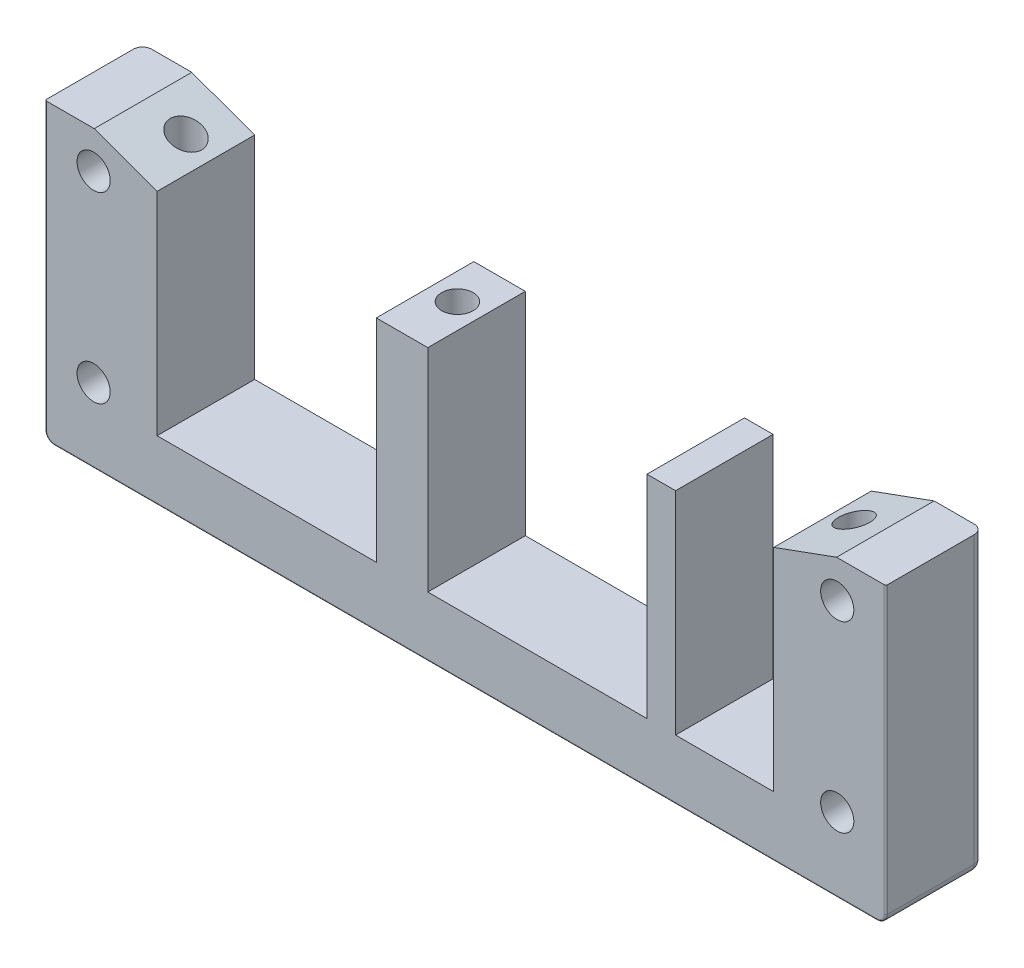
ISO-10303-21;
HEADER;
FILE_DESCRIPTION(('STEP AP214'),'2;1');
FILE_NAME('part.step','',(''),(''),'','','');
FILE_SCHEMA(('AUTOMOTIVE_DESIGN { 1 0 10303 214 1 1 1 1 }'));
ENDSEC;
DATA;
#1=APPLICATION_CONTEXT('core data for automotive mechanical design processes');
#2=APPLICATION_PROTOCOL_DEFINITION('international standard','automotive_design',2000,#1);
#3=PRODUCT_CONTEXT('',#1,'mechanical');
#4=PRODUCT('Part','Part','',(#3));
#5=PRODUCT_RELATED_PRODUCT_CATEGORY('part','',(#4));
#6=PRODUCT_DEFINITION_FORMATION('','',#4);
#7=PRODUCT_DEFINITION_CONTEXT('part definition',#1,'design');
#8=PRODUCT_DEFINITION('design','',#6,#7);
#9=PRODUCT_DEFINITION_SHAPE('','',#8);
#10=(LENGTH_UNIT() NAMED_UNIT(*) SI_UNIT(.MILLI.,.METRE.));
#11=(NAMED_UNIT(*) PLANE_ANGLE_UNIT() SI_UNIT($,.RADIAN.));
#12=(NAMED_UNIT(*) SI_UNIT($,.STERADIAN.) SOLID_ANGLE_UNIT());
#13=UNCERTAINTY_MEASURE_WITH_UNIT(LENGTH_MEASURE(1.E-05),#10,'distance_accuracy_value','');
#14=(GEOMETRIC_REPRESENTATION_CONTEXT(3) GLOBAL_UNCERTAINTY_ASSIGNED_CONTEXT((#13)) GLOBAL_UNIT_ASSIGNED_CONTEXT((#10,
#11,#12)) REPRESENTATION_CONTEXT('',''));
#15=CARTESIAN_POINT('',(0.,0.,0.));
#16=DIRECTION('',(0.,0.,1.));
#17=DIRECTION('',(1.,0.,0.));
#18=AXIS2_PLACEMENT_3D('',#15,#16,#17);
#19=CARTESIAN_POINT('',(60.7671361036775,-22.,3.4));
#20=DIRECTION('',(0.86602540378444,0.,-0.5));
#21=DIRECTION('',(0.,-1.,0.));
#22=AXIS2_PLACEMENT_3D('',#19,#20,#21);
#23=PLANE('',#22);
#24=DIRECTION('',(0.5,0.,0.86602540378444));
#25=VECTOR('',#24,1.);
#26=CARTESIAN_POINT('',(60.7671361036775,-29.,3.4));
#27=LINE('',#26,#25);
#28=CARTESIAN_POINT('',(60.7671361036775,-29.,3.4));
#29=VERTEX_POINT('',#28);
#30=CARTESIAN_POINT('',(63.1342722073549,-29.,7.5));
#31=VERTEX_POINT('',#30);
#32=EDGE_CURVE('E1035',#29,#31,#27,.T.);
#33=ORIENTED_EDGE('',*,*,#32,.T.);
#34=DIRECTION('',(0.,-1.,0.));
#35=VECTOR('',#34,1.);
#36=CARTESIAN_POINT('',(63.1342722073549,-22.,7.5));
#37=LINE('',#36,#35);
#38=CARTESIAN_POINT('',(63.1342722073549,-22.,7.5));
#39=VERTEX_POINT('',#38);
#40=EDGE_CURVE('E11',#39,#31,#37,.T.);
#41=ORIENTED_EDGE('',*,*,#40,.F.);
#42=DIRECTION('',(0.5,0.,0.86602540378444));
#43=VECTOR('',#42,1.);
#44=CARTESIAN_POINT('',(60.7671361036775,-22.,3.4));
#45=LINE('',#44,#43);
#46=CARTESIAN_POINT('',(60.7671361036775,-22.,3.4));
#47=VERTEX_POINT('',#46);
#48=EDGE_CURVE('E759',#47,#39,#45,.T.);
#49=ORIENTED_EDGE('',*,*,#48,.F.);
#50=DIRECTION('',(0.,-1.,0.));
#51=VECTOR('',#50,1.);
#52=CARTESIAN_POINT('',(60.7671361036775,-22.,3.4));
#53=LINE('',#52,#51);
#54=EDGE_CURVE('E779',#47,#29,#53,.T.);
#55=ORIENTED_EDGE('',*,*,#54,.T.);
#56=EDGE_LOOP('',(#33,#41,#49,#55));
#57=FACE_BOUND('',#56,.T.);
#58=ADVANCED_FACE('F16',(#57),#23,.F.);
#59=CARTESIAN_POINT('',(63.1342722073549,-22.,7.5));
#60=DIRECTION('',(0.86602540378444,0.,0.5));
#61=DIRECTION('',(0.,-1.,0.));
#62=AXIS2_PLACEMENT_3D('',#59,#60,#61);
#63=PLANE('',#62);
#64=DIRECTION('',(-0.5,0.,0.86602540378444));
#65=VECTOR('',#64,1.);
#66=CARTESIAN_POINT('',(63.1342722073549,-29.,7.5));
#67=LINE('',#66,#65);
#68=CARTESIAN_POINT('',(60.7671361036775,-29.,11.6));
#69=VERTEX_POINT('',#68);
#70=EDGE_CURVE('E795',#31,#69,#67,.T.);
#71=ORIENTED_EDGE('',*,*,#70,.T.);
#72=DIRECTION('',(0.,-1.,0.));
#73=VECTOR('',#72,1.);
#74=CARTESIAN_POINT('',(60.7671361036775,-22.,11.6));
#75=LINE('',#74,#73);
#76=CARTESIAN_POINT('',(60.7671361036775,-22.,11.6));
#77=VERTEX_POINT('',#76);
#78=EDGE_CURVE('E24',#77,#69,#75,.T.);
#79=ORIENTED_EDGE('',*,*,#78,.F.);
#80=DIRECTION('',(-0.5,0.,0.86602540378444));
#81=VECTOR('',#80,1.);
#82=CARTESIAN_POINT('',(63.1342722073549,-22.,7.5));
#83=LINE('',#82,#81);
#84=EDGE_CURVE('E763',#39,#77,#83,.T.);
#85=ORIENTED_EDGE('',*,*,#84,.F.);
#86=ORIENTED_EDGE('',*,*,#40,.T.);
#87=EDGE_LOOP('',(#71,#79,#85,#86));
#88=FACE_BOUND('',#87,.T.);
#89=ADVANCED_FACE('F796',(#88),#63,.F.);
#90=CARTESIAN_POINT('',(60.7671361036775,-22.,11.6));
#91=DIRECTION('',(0.,0.,1.));
#92=DIRECTION('',(1.,0.,0.));
#93=AXIS2_PLACEMENT_3D('',#90,#91,#92);
#94=PLANE('',#93);
#95=DIRECTION('',(-1.,0.,0.));
#96=VECTOR('',#95,1.);
#97=CARTESIAN_POINT('',(60.7671361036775,-29.,11.6));
#98=LINE('',#97,#96);
#99=CARTESIAN_POINT('',(56.0328638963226,-29.,11.6));
#100=VERTEX_POINT('',#99);
#101=EDGE_CURVE('E790',#69,#100,#98,.T.);
#102=ORIENTED_EDGE('',*,*,#101,.T.);
#103=DIRECTION('',(0.,-1.,0.));
#104=VECTOR('',#103,1.);
#105=CARTESIAN_POINT('',(56.0328638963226,-22.,11.6));
#106=LINE('',#105,#104);
#107=CARTESIAN_POINT('',(56.0328638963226,-22.,11.6));
#108=VERTEX_POINT('',#107);
#109=EDGE_CURVE('E48',#108,#100,#106,.T.);
#110=ORIENTED_EDGE('',*,*,#109,.F.);
#111=DIRECTION('',(-1.,0.,0.));
#112=VECTOR('',#111,1.);
#113=CARTESIAN_POINT('',(60.7671361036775,-22.,11.6));
#114=LINE('',#113,#112);
#115=EDGE_CURVE('E767',#77,#108,#114,.T.);
#116=ORIENTED_EDGE('',*,*,#115,.F.);
#117=ORIENTED_EDGE('',*,*,#78,.T.);
#118=EDGE_LOOP('',(#102,#110,#116,#117));
#119=FACE_BOUND('',#118,.T.);
#120=ADVANCED_FACE('F788',(#119),#94,.F.);
#121=CARTESIAN_POINT('',(56.0328638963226,-22.,11.6));
#122=DIRECTION('',(-0.866025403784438,0.,0.5));
#123=DIRECTION('',(0.,1.,0.));
#124=AXIS2_PLACEMENT_3D('',#121,#122,#123);
#125=PLANE('',#124);
#126=DIRECTION('',(-0.5,0.,-0.866025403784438));
#127=VECTOR('',#126,1.);
#128=CARTESIAN_POINT('',(56.0328638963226,-29.,11.6));
#129=LINE('',#128,#127);
#130=CARTESIAN_POINT('',(53.6657277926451,-29.,7.5));
#131=VERTEX_POINT('',#130);
#132=EDGE_CURVE('E806',#100,#131,#129,.T.);
#133=ORIENTED_EDGE('',*,*,#132,.T.);
#134=DIRECTION('',(0.,-1.,0.));
#135=VECTOR('',#134,1.);
#136=CARTESIAN_POINT('',(53.6657277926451,-22.,7.5));
#137=LINE('',#136,#135);
#138=CARTESIAN_POINT('',(53.6657277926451,-22.,7.5));
#139=VERTEX_POINT('',#138);
#140=EDGE_CURVE('E35',#139,#131,#137,.T.);
#141=ORIENTED_EDGE('',*,*,#140,.F.);
#142=DIRECTION('',(-0.5,0.,-0.866025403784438));
#143=VECTOR('',#142,1.);
#144=CARTESIAN_POINT('',(56.0328638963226,-22.,11.6));
#145=LINE('',#144,#143);
#146=EDGE_CURVE('E771',#108,#139,#145,.T.);
#147=ORIENTED_EDGE('',*,*,#146,.F.);
#148=ORIENTED_EDGE('',*,*,#109,.T.);
#149=EDGE_LOOP('',(#133,#141,#147,#148));
#150=FACE_BOUND('',#149,.T.);
#151=ADVANCED_FACE('F1058',(#150),#125,.F.);
#152=CARTESIAN_POINT('',(53.6657277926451,-22.,7.5));
#153=DIRECTION('',(-0.866025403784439,0.,-0.5));
#154=DIRECTION('',(-0.5,0.,0.866025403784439));
#155=AXIS2_PLACEMENT_3D('',#152,#153,#154);
#156=PLANE('',#155);
#157=DIRECTION('',(0.5,0.,-0.866025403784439));
#158=VECTOR('',#157,1.);
#159=CARTESIAN_POINT('',(53.6657277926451,-29.,7.5));
#160=LINE('',#159,#158);
#161=CARTESIAN_POINT('',(56.0328638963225,-29.,3.4));
#162=VERTEX_POINT('',#161);
#163=EDGE_CURVE('E812',#131,#162,#160,.T.);
#164=ORIENTED_EDGE('',*,*,#163,.T.);
#165=DIRECTION('',(0.,-1.,0.));
#166=VECTOR('',#165,1.);
#167=CARTESIAN_POINT('',(56.0328638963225,-22.,3.4));
#168=LINE('',#167,#166);
#169=CARTESIAN_POINT('',(56.0328638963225,-22.,3.4));
#170=VERTEX_POINT('',#169);
#171=EDGE_CURVE('E651',#170,#162,#168,.T.);
#172=ORIENTED_EDGE('',*,*,#171,.F.);
#173=DIRECTION('',(0.5,0.,-0.866025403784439));
#174=VECTOR('',#173,1.);
#175=CARTESIAN_POINT('',(53.6657277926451,-22.,7.5));
#176=LINE('',#175,#174);
#177=EDGE_CURVE('E775',#139,#170,#176,.T.);
#178=ORIENTED_EDGE('',*,*,#177,.F.);
#179=ORIENTED_EDGE('',*,*,#140,.T.);
#180=EDGE_LOOP('',(#164,#172,#178,#179));
#181=FACE_BOUND('',#180,.T.);
#182=ADVANCED_FACE('F1057',(#181),#156,.F.);
#183=CARTESIAN_POINT('',(56.0328638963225,-22.,3.4));
#184=DIRECTION('',(0.,0.,-1.));
#185=DIRECTION('',(-1.,0.,0.));
#186=AXIS2_PLACEMENT_3D('',#183,#184,#185);
#187=PLANE('',#186);
#188=DIRECTION('',(1.,0.,0.));
#189=VECTOR('',#188,1.);
#190=CARTESIAN_POINT('',(56.0328638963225,-29.,3.4));
#191=LINE('',#190,#189);
#192=EDGE_CURVE('E964',#162,#29,#191,.T.);
#193=ORIENTED_EDGE('',*,*,#192,.T.);
#194=ORIENTED_EDGE('',*,*,#54,.F.);
#195=DIRECTION('',(1.,0.,0.));
#196=VECTOR('',#195,1.);
#197=CARTESIAN_POINT('',(56.0328638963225,-22.,3.4));
#198=LINE('',#197,#196);
#199=EDGE_CURVE('E755',#170,#47,#198,.T.);
#200=ORIENTED_EDGE('',*,*,#199,.F.);
#201=ORIENTED_EDGE('',*,*,#171,.T.);
#202=EDGE_LOOP('',(#193,#194,#200,#201));
#203=FACE_BOUND('',#202,.T.);
#204=ADVANCED_FACE('F1051',(#203),#187,.F.);
#205=CARTESIAN_POINT('',(0.,-22.,0.));
#206=DIRECTION('',(0.,-1.,0.));
#207=DIRECTION('',(0.,0.,-1.));
#208=AXIS2_PLACEMENT_3D('',#205,#206,#207);
#209=PLANE('',#208);
#210=CARTESIAN_POINT('',(58.4,-22.,7.5));
#211=DIRECTION('',(0.,1.,0.));
#212=DIRECTION('',(0.,0.,-1.));
#213=AXIS2_PLACEMENT_3D('',#210,#211,#212);
#214=CIRCLE('',#213,2.75);
#215=CARTESIAN_POINT('',(58.4,-22.,4.75));
#216=VERTEX_POINT('',#215);
#217=EDGE_CURVE('E1206',#216,#216,#214,.T.);
#218=ORIENTED_EDGE('',*,*,#217,.T.);
#219=EDGE_LOOP('',(#218));
#220=FACE_BOUND('',#219,.T.);
#221=ORIENTED_EDGE('',*,*,#199,.T.);
#222=ORIENTED_EDGE('',*,*,#48,.T.);
#223=ORIENTED_EDGE('',*,*,#84,.T.);
#224=ORIENTED_EDGE('',*,*,#115,.T.);
#225=ORIENTED_EDGE('',*,*,#146,.T.);
#226=ORIENTED_EDGE('',*,*,#177,.T.);
#227=EDGE_LOOP('',(#221,#222,#223,#224,#225,#226));
#228=FACE_BOUND('',#227,.T.);
#229=ADVANCED_FACE('F1060',(#220,#228),#209,.T.);
#230=CARTESIAN_POINT('',(-8.58286389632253,-22.,3.4));
#231=DIRECTION('',(0.866025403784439,0.,-0.5));
#232=DIRECTION('',(0.,-1.,0.));
#233=AXIS2_PLACEMENT_3D('',#230,#231,#232);
#234=PLANE('',#233);
#235=DIRECTION('',(0.5,0.,0.866025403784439));
#236=VECTOR('',#235,1.);
#237=CARTESIAN_POINT('',(-8.58286389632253,-29.,3.4));
#238=LINE('',#237,#236);
#239=CARTESIAN_POINT('',(-8.58286389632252,-29.,3.4));
#240=VERTEX_POINT('',#239);
#241=CARTESIAN_POINT('',(-6.21572779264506,-29.,7.5));
#242=VERTEX_POINT('',#241);
#243=EDGE_CURVE('E801',#240,#242,#238,.T.);
#244=ORIENTED_EDGE('',*,*,#243,.T.);
#245=DIRECTION('',(0.,-1.,0.));
#246=VECTOR('',#245,1.);
#247=CARTESIAN_POINT('',(-6.21572779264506,-22.,7.5));
#248=LINE('',#247,#246);
#249=CARTESIAN_POINT('',(-6.21572779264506,-22.,7.5));
#250=VERTEX_POINT('',#249);
#251=EDGE_CURVE('E752',#250,#242,#248,.T.);
#252=ORIENTED_EDGE('',*,*,#251,.F.);
#253=DIRECTION('',(0.5,0.,0.866025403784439));
#254=VECTOR('',#253,1.);
#255=CARTESIAN_POINT('',(-8.58286389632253,-22.,3.4));
#256=LINE('',#255,#254);
#257=CARTESIAN_POINT('',(-8.58286389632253,-22.,3.4));
#258=VERTEX_POINT('',#257);
#259=EDGE_CURVE('E472',#258,#250,#256,.T.);
#260=ORIENTED_EDGE('',*,*,#259,.F.);
#261=DIRECTION('',(0.,-1.,0.));
#262=VECTOR('',#261,1.);
#263=CARTESIAN_POINT('',(-8.58286389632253,-22.,3.4));
#264=LINE('',#263,#262);
#265=EDGE_CURVE('E742',#258,#240,#264,.T.);
#266=ORIENTED_EDGE('',*,*,#265,.T.);
#267=EDGE_LOOP('',(#244,#252,#260,#266));
#268=FACE_BOUND('',#267,.T.);
#269=ADVANCED_FACE('F1192',(#268),#234,.F.);
#270=CARTESIAN_POINT('',(-6.21572779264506,-22.,7.5));
#271=DIRECTION('',(0.866025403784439,0.,0.5));
#272=DIRECTION('',(0.,-1.,0.));
#273=AXIS2_PLACEMENT_3D('',#270,#271,#272);
#274=PLANE('',#273);
#275=DIRECTION('',(-0.5,0.,0.866025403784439));
#276=VECTOR('',#275,1.);
#277=CARTESIAN_POINT('',(-6.21572779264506,-29.,7.5));
#278=LINE('',#277,#276);
#279=CARTESIAN_POINT('',(-8.58286389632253,-29.,11.6));
#280=VERTEX_POINT('',#279);
#281=EDGE_CURVE('E846',#242,#280,#278,.T.);
#282=ORIENTED_EDGE('',*,*,#281,.T.);
#283=DIRECTION('',(0.,-1.,0.));
#284=VECTOR('',#283,1.);
#285=CARTESIAN_POINT('',(-8.58286389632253,-22.,11.6));
#286=LINE('',#285,#284);
#287=CARTESIAN_POINT('',(-8.58286389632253,-22.,11.6));
#288=VERTEX_POINT('',#287);
#289=EDGE_CURVE('E449',#288,#280,#286,.T.);
#290=ORIENTED_EDGE('',*,*,#289,.F.);
#291=DIRECTION('',(-0.5,0.,0.866025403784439));
#292=VECTOR('',#291,1.);
#293=CARTESIAN_POINT('',(-6.21572779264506,-22.,7.5));
#294=LINE('',#293,#292);
#295=EDGE_CURVE('E465',#250,#288,#294,.T.);
#296=ORIENTED_EDGE('',*,*,#295,.F.);
#297=ORIENTED_EDGE('',*,*,#251,.T.);
#298=EDGE_LOOP('',(#282,#290,#296,#297));
#299=FACE_BOUND('',#298,.T.);
#300=ADVANCED_FACE('F1189',(#299),#274,.F.);
#301=CARTESIAN_POINT('',(-8.58286389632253,-22.,11.6));
#302=DIRECTION('',(0.,0.,1.));
#303=DIRECTION('',(1.,0.,0.));
#304=AXIS2_PLACEMENT_3D('',#301,#302,#303);
#305=PLANE('',#304);
#306=DIRECTION('',(-1.,0.,0.));
#307=VECTOR('',#306,1.);
#308=CARTESIAN_POINT('',(-8.58286389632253,-29.,11.6));
#309=LINE('',#308,#307);
#310=CARTESIAN_POINT('',(-13.3171361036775,-29.,11.6));
#311=VERTEX_POINT('',#310);
#312=EDGE_CURVE('E444',#280,#311,#309,.T.);
#313=ORIENTED_EDGE('',*,*,#312,.T.);
#314=DIRECTION('',(0.,-1.,0.));
#315=VECTOR('',#314,1.);
#316=CARTESIAN_POINT('',(-13.3171361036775,-22.,11.6));
#317=LINE('',#316,#315);
#318=CARTESIAN_POINT('',(-13.3171361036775,-22.,11.6));
#319=VERTEX_POINT('',#318);
#320=EDGE_CURVE('E437',#319,#311,#317,.T.);
#321=ORIENTED_EDGE('',*,*,#320,.F.);
#322=DIRECTION('',(-1.,0.,0.));
#323=VECTOR('',#322,1.);
#324=CARTESIAN_POINT('',(-8.58286389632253,-22.,11.6));
#325=LINE('',#324,#323);
#326=EDGE_CURVE('E441',#288,#319,#325,.T.);
#327=ORIENTED_EDGE('',*,*,#326,.F.);
#328=ORIENTED_EDGE('',*,*,#289,.T.);
#329=EDGE_LOOP('',(#313,#321,#327,#328));
#330=FACE_BOUND('',#329,.T.);
#331=ADVANCED_FACE('F439',(#330),#305,.F.);
#332=CARTESIAN_POINT('',(-13.3171361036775,-22.,11.6));
#333=DIRECTION('',(-0.866025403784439,0.,0.5));
#334=DIRECTION('',(0.,1.,0.));
#335=AXIS2_PLACEMENT_3D('',#332,#333,#334);
#336=PLANE('',#335);
#337=DIRECTION('',(-0.5,0.,-0.866025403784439));
#338=VECTOR('',#337,1.);
#339=CARTESIAN_POINT('',(-13.3171361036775,-29.,11.6));
#340=LINE('',#339,#338);
#341=CARTESIAN_POINT('',(-15.6842722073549,-29.,7.5));
#342=VERTEX_POINT('',#341);
#343=EDGE_CURVE('E838',#311,#342,#340,.T.);
#344=ORIENTED_EDGE('',*,*,#343,.T.);
#345=DIRECTION('',(0.,-1.,0.));
#346=VECTOR('',#345,1.);
#347=CARTESIAN_POINT('',(-15.6842722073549,-22.,7.5));
#348=LINE('',#347,#346);
#349=CARTESIAN_POINT('',(-15.6842722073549,-22.,7.5));
#350=VERTEX_POINT('',#349);
#351=EDGE_CURVE('E450',#350,#342,#348,.T.);
#352=ORIENTED_EDGE('',*,*,#351,.F.);
#353=DIRECTION('',(-0.5,0.,-0.866025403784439));
#354=VECTOR('',#353,1.);
#355=CARTESIAN_POINT('',(-13.3171361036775,-22.,11.6));
#356=LINE('',#355,#354);
#357=EDGE_CURVE('E453',#319,#350,#356,.T.);
#358=ORIENTED_EDGE('',*,*,#357,.F.);
#359=ORIENTED_EDGE('',*,*,#320,.T.);
#360=EDGE_LOOP('',(#344,#352,#358,#359));
#361=FACE_BOUND('',#360,.T.);
#362=ADVANCED_FACE('F454',(#361),#336,.F.);
#363=CARTESIAN_POINT('',(-15.6842722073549,-22.,7.5));
#364=DIRECTION('',(-0.866025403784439,0.,-0.5));
#365=DIRECTION('',(-0.5,0.,0.866025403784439));
#366=AXIS2_PLACEMENT_3D('',#363,#364,#365);
#367=PLANE('',#366);
#368=DIRECTION('',(0.5,0.,-0.866025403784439));
#369=VECTOR('',#368,1.);
#370=CARTESIAN_POINT('',(-15.6842722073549,-29.,7.5));
#371=LINE('',#370,#369);
#372=CARTESIAN_POINT('',(-13.3171361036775,-29.,3.4));
#373=VERTEX_POINT('',#372);
#374=EDGE_CURVE('E827',#342,#373,#371,.T.);
#375=ORIENTED_EDGE('',*,*,#374,.T.);
#376=DIRECTION('',(0.,-1.,0.));
#377=VECTOR('',#376,1.);
#378=CARTESIAN_POINT('',(-13.3171361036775,-22.,3.4));
#379=LINE('',#378,#377);
#380=CARTESIAN_POINT('',(-13.3171361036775,-22.,3.4));
#381=VERTEX_POINT('',#380);
#382=EDGE_CURVE('E745',#381,#373,#379,.T.);
#383=ORIENTED_EDGE('',*,*,#382,.F.);
#384=DIRECTION('',(0.5,0.,-0.866025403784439));
#385=VECTOR('',#384,1.);
#386=CARTESIAN_POINT('',(-15.6842722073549,-22.,7.5));
#387=LINE('',#386,#385);
#388=EDGE_CURVE('E459',#350,#381,#387,.T.);
#389=ORIENTED_EDGE('',*,*,#388,.F.);
#390=ORIENTED_EDGE('',*,*,#351,.T.);
#391=EDGE_LOOP('',(#375,#383,#389,#390));
#392=FACE_BOUND('',#391,.T.);
#393=ADVANCED_FACE('F1181',(#392),#367,.F.);
#394=CARTESIAN_POINT('',(-13.3171361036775,-22.,3.4));
#395=DIRECTION('',(0.,0.,-1.));
#396=DIRECTION('',(0.,-1.,0.));
#397=AXIS2_PLACEMENT_3D('',#394,#395,#396);
#398=PLANE('',#397);
#399=DIRECTION('',(1.,0.,0.));
#400=VECTOR('',#399,1.);
#401=CARTESIAN_POINT('',(-13.3171361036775,-29.,3.4));
#402=LINE('',#401,#400);
#403=EDGE_CURVE('E821',#373,#240,#402,.T.);
#404=ORIENTED_EDGE('',*,*,#403,.T.);
#405=ORIENTED_EDGE('',*,*,#265,.F.);
#406=DIRECTION('',(1.,0.,0.));
#407=VECTOR('',#406,1.);
#408=CARTESIAN_POINT('',(-13.3171361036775,-22.,3.4));
#409=LINE('',#408,#407);
#410=EDGE_CURVE('E555',#381,#258,#409,.T.);
#411=ORIENTED_EDGE('',*,*,#410,.F.);
#412=ORIENTED_EDGE('',*,*,#382,.T.);
#413=EDGE_LOOP('',(#404,#405,#411,#412));
#414=FACE_BOUND('',#413,.T.);
#415=ADVANCED_FACE('F1177',(#414),#398,.F.);
#416=CARTESIAN_POINT('',(0.,-22.,0.));
#417=DIRECTION('',(0.,-1.,0.));
#418=DIRECTION('',(0.,0.,-1.));
#419=AXIS2_PLACEMENT_3D('',#416,#417,#418);
#420=PLANE('',#419);
#421=CARTESIAN_POINT('',(-10.95,-22.,7.5));
#422=DIRECTION('',(0.,1.,0.));
#423=DIRECTION('',(1.,0.,0.));
#424=AXIS2_PLACEMENT_3D('',#421,#422,#423);
#425=CIRCLE('',#424,2.75);
#426=CARTESIAN_POINT('',(-8.2,-22.,7.5));
#427=VERTEX_POINT('',#426);
#428=EDGE_CURVE('E1003',#427,#427,#425,.T.);
#429=ORIENTED_EDGE('',*,*,#428,.T.);
#430=EDGE_LOOP('',(#429));
#431=FACE_BOUND('',#430,.T.);
#432=ORIENTED_EDGE('',*,*,#410,.T.);
#433=ORIENTED_EDGE('',*,*,#259,.T.);
#434=ORIENTED_EDGE('',*,*,#295,.T.);
#435=ORIENTED_EDGE('',*,*,#326,.T.);
#436=ORIENTED_EDGE('',*,*,#357,.T.);
#437=ORIENTED_EDGE('',*,*,#388,.T.);
#438=EDGE_LOOP('',(#432,#433,#434,#435,#436,#437));
#439=FACE_BOUND('',#438,.T.);
#440=ADVANCED_FACE('F462',(#431,#439),#420,.T.);
#441=CARTESIAN_POINT('',(-56.0328638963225,-22.,3.4));
#442=DIRECTION('',(0.866025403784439,0.,-0.5));
#443=DIRECTION('',(0.,-1.,0.));
#444=AXIS2_PLACEMENT_3D('',#441,#442,#443);
#445=PLANE('',#444);
#446=DIRECTION('',(0.5,0.,0.866025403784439));
#447=VECTOR('',#446,1.);
#448=CARTESIAN_POINT('',(-56.0328638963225,-29.,3.4));
#449=LINE('',#448,#447);
#450=CARTESIAN_POINT('',(-56.0328638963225,-29.,3.4));
#451=VERTEX_POINT('',#450);
#452=CARTESIAN_POINT('',(-53.6657277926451,-29.,7.5));
#453=VERTEX_POINT('',#452);
#454=EDGE_CURVE('E854',#451,#453,#449,.T.);
#455=ORIENTED_EDGE('',*,*,#454,.T.);
#456=DIRECTION('',(0.,-1.,0.));
#457=VECTOR('',#456,1.);
#458=CARTESIAN_POINT('',(-53.6657277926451,-22.,7.5));
#459=LINE('',#458,#457);
#460=CARTESIAN_POINT('',(-53.6657277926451,-22.,7.5));
#461=VERTEX_POINT('',#460);
#462=EDGE_CURVE('E735',#461,#453,#459,.T.);
#463=ORIENTED_EDGE('',*,*,#462,.F.);
#464=DIRECTION('',(0.5,0.,0.866025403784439));
#465=VECTOR('',#464,1.);
#466=CARTESIAN_POINT('',(-56.0328638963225,-22.,3.4));
#467=LINE('',#466,#465);
#468=CARTESIAN_POINT('',(-56.0328638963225,-22.,3.4));
#469=VERTEX_POINT('',#468);
#470=EDGE_CURVE('E493',#469,#461,#467,.T.);
#471=ORIENTED_EDGE('',*,*,#470,.F.);
#472=DIRECTION('',(0.,-1.,0.));
#473=VECTOR('',#472,1.);
#474=CARTESIAN_POINT('',(-56.0328638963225,-22.,3.4));
#475=LINE('',#474,#473);
#476=EDGE_CURVE('E720',#469,#451,#475,.T.);
#477=ORIENTED_EDGE('',*,*,#476,.T.);
#478=EDGE_LOOP('',(#455,#463,#471,#477));
#479=FACE_BOUND('',#478,.T.);
#480=ADVANCED_FACE('F1099',(#479),#445,.F.);
#481=CARTESIAN_POINT('',(-53.6657277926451,-22.,7.5));
#482=DIRECTION('',(0.866025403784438,0.,0.5));
#483=DIRECTION('',(0.,-1.,0.));
#484=AXIS2_PLACEMENT_3D('',#481,#482,#483);
#485=PLANE('',#484);
#486=DIRECTION('',(-0.5,0.,0.866025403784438));
#487=VECTOR('',#486,1.);
#488=CARTESIAN_POINT('',(-53.6657277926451,-29.,7.5));
#489=LINE('',#488,#487);
#490=CARTESIAN_POINT('',(-56.0328638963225,-29.,11.6));
#491=VERTEX_POINT('',#490);
#492=EDGE_CURVE('E877',#453,#491,#489,.T.);
#493=ORIENTED_EDGE('',*,*,#492,.T.);
#494=DIRECTION('',(0.,-1.,0.));
#495=VECTOR('',#494,1.);
#496=CARTESIAN_POINT('',(-56.0328638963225,-22.,11.6));
#497=LINE('',#496,#495);
#498=CARTESIAN_POINT('',(-56.0328638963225,-22.,11.6));
#499=VERTEX_POINT('',#498);
#500=EDGE_CURVE('E732',#499,#491,#497,.T.);
#501=ORIENTED_EDGE('',*,*,#500,.F.);
#502=DIRECTION('',(-0.5,0.,0.866025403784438));
#503=VECTOR('',#502,1.);
#504=CARTESIAN_POINT('',(-53.6657277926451,-22.,7.5));
#505=LINE('',#504,#503);
#506=EDGE_CURVE('E497',#461,#499,#505,.T.);
#507=ORIENTED_EDGE('',*,*,#506,.F.);
#508=ORIENTED_EDGE('',*,*,#462,.T.);
#509=EDGE_LOOP('',(#493,#501,#507,#508));
#510=FACE_BOUND('',#509,.T.);
#511=ADVANCED_FACE('F1102',(#510),#485,.F.);
#512=CARTESIAN_POINT('',(-56.0328638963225,-22.,11.6));
#513=DIRECTION('',(0.,0.,1.));
#514=DIRECTION('',(1.,0.,0.));
#515=AXIS2_PLACEMENT_3D('',#512,#513,#514);
#516=PLANE('',#515);
#517=DIRECTION('',(-1.,0.,0.));
#518=VECTOR('',#517,1.);
#519=CARTESIAN_POINT('',(-56.0328638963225,-29.,11.6));
#520=LINE('',#519,#518);
#521=CARTESIAN_POINT('',(-60.7671361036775,-29.,11.6));
#522=VERTEX_POINT('',#521);
#523=EDGE_CURVE('E873',#491,#522,#520,.T.);
#524=ORIENTED_EDGE('',*,*,#523,.T.);
#525=DIRECTION('',(0.,-1.,0.));
#526=VECTOR('',#525,1.);
#527=CARTESIAN_POINT('',(-60.7671361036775,-22.,11.6));
#528=LINE('',#527,#526);
#529=CARTESIAN_POINT('',(-60.7671361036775,-22.,11.6));
#530=VERTEX_POINT('',#529);
#531=EDGE_CURVE('E729',#530,#522,#528,.T.);
#532=ORIENTED_EDGE('',*,*,#531,.F.);
#533=DIRECTION('',(-1.,0.,0.));
#534=VECTOR('',#533,1.);
#535=CARTESIAN_POINT('',(-56.0328638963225,-22.,11.6));
#536=LINE('',#535,#534);
#537=EDGE_CURVE('E708',#499,#530,#536,.T.);
#538=ORIENTED_EDGE('',*,*,#537,.F.);
#539=ORIENTED_EDGE('',*,*,#500,.T.);
#540=EDGE_LOOP('',(#524,#532,#538,#539));
#541=FACE_BOUND('',#540,.T.);
#542=ADVANCED_FACE('F1170',(#541),#516,.F.);
#543=CARTESIAN_POINT('',(-60.7671361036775,-22.,11.6));
#544=DIRECTION('',(-0.866025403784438,0.,0.5));
#545=DIRECTION('',(0.,1.,0.));
#546=AXIS2_PLACEMENT_3D('',#543,#544,#545);
#547=PLANE('',#546);
#548=DIRECTION('',(-0.5,0.,-0.866025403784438));
#549=VECTOR('',#548,1.);
#550=CARTESIAN_POINT('',(-60.7671361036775,-29.,11.6));
#551=LINE('',#550,#549);
#552=CARTESIAN_POINT('',(-63.1342722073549,-29.,7.5));
#553=VERTEX_POINT('',#552);
#554=EDGE_CURVE('E869',#522,#553,#551,.T.);
#555=ORIENTED_EDGE('',*,*,#554,.T.);
#556=DIRECTION('',(0.,-1.,0.));
#557=VECTOR('',#556,1.);
#558=CARTESIAN_POINT('',(-63.1342722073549,-22.,7.5));
#559=LINE('',#558,#557);
#560=CARTESIAN_POINT('',(-63.1342722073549,-22.,7.5));
#561=VERTEX_POINT('',#560);
#562=EDGE_CURVE('E726',#561,#553,#559,.T.);
#563=ORIENTED_EDGE('',*,*,#562,.F.);
#564=DIRECTION('',(-0.5,0.,-0.866025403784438));
#565=VECTOR('',#564,1.);
#566=CARTESIAN_POINT('',(-60.7671361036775,-22.,11.6));
#567=LINE('',#566,#565);
#568=EDGE_CURVE('E712',#530,#561,#567,.T.);
#569=ORIENTED_EDGE('',*,*,#568,.F.);
#570=ORIENTED_EDGE('',*,*,#531,.T.);
#571=EDGE_LOOP('',(#555,#563,#569,#570));
#572=FACE_BOUND('',#571,.T.);
#573=ADVANCED_FACE('F1166',(#572),#547,.F.);
#574=CARTESIAN_POINT('',(-63.1342722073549,-22.,7.5));
#575=DIRECTION('',(-0.866025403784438,0.,-0.5));
#576=DIRECTION('',(-0.5,0.,0.866025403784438));
#577=AXIS2_PLACEMENT_3D('',#574,#575,#576);
#578=PLANE('',#577);
#579=DIRECTION('',(0.5,0.,-0.866025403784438));
#580=VECTOR('',#579,1.);
#581=CARTESIAN_POINT('',(-63.1342722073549,-29.,7.5));
#582=LINE('',#581,#580);
#583=CARTESIAN_POINT('',(-60.7671361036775,-29.,3.4));
#584=VERTEX_POINT('',#583);
#585=EDGE_CURVE('E862',#553,#584,#582,.T.);
#586=ORIENTED_EDGE('',*,*,#585,.T.);
#587=DIRECTION('',(0.,-1.,0.));
#588=VECTOR('',#587,1.);
#589=CARTESIAN_POINT('',(-60.7671361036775,-22.,3.4));
#590=LINE('',#589,#588);
#591=CARTESIAN_POINT('',(-60.7671361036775,-22.,3.4));
#592=VERTEX_POINT('',#591);
#593=EDGE_CURVE('E723',#592,#584,#590,.T.);
#594=ORIENTED_EDGE('',*,*,#593,.F.);
#595=DIRECTION('',(0.5,0.,-0.866025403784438));
#596=VECTOR('',#595,1.);
#597=CARTESIAN_POINT('',(-63.1342722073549,-22.,7.5));
#598=LINE('',#597,#596);
#599=EDGE_CURVE('E716',#561,#592,#598,.T.);
#600=ORIENTED_EDGE('',*,*,#599,.F.);
#601=ORIENTED_EDGE('',*,*,#562,.T.);
#602=EDGE_LOOP('',(#586,#594,#600,#601));
#603=FACE_BOUND('',#602,.T.);
#604=ADVANCED_FACE('F1162',(#603),#578,.F.);
#605=CARTESIAN_POINT('',(-60.7671361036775,-22.,3.4));
#606=DIRECTION('',(0.,0.,-1.));
#607=DIRECTION('',(0.,-1.,0.));
#608=AXIS2_PLACEMENT_3D('',#605,#606,#607);
#609=PLANE('',#608);
#610=DIRECTION('',(1.,0.,0.));
#611=VECTOR('',#610,1.);
#612=CARTESIAN_POINT('',(-60.7671361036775,-29.,3.4));
#613=LINE('',#612,#611);
#614=EDGE_CURVE('E858',#584,#451,#613,.T.);
#615=ORIENTED_EDGE('',*,*,#614,.T.);
#616=ORIENTED_EDGE('',*,*,#476,.F.);
#617=DIRECTION('',(1.,0.,0.));
#618=VECTOR('',#617,1.);
#619=CARTESIAN_POINT('',(-60.7671361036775,-22.,3.4));
#620=LINE('',#619,#618);
#621=EDGE_CURVE('E498',#592,#469,#620,.T.);
#622=ORIENTED_EDGE('',*,*,#621,.F.);
#623=ORIENTED_EDGE('',*,*,#593,.T.);
#624=EDGE_LOOP('',(#615,#616,#622,#623));
#625=FACE_BOUND('',#624,.T.);
#626=ADVANCED_FACE('F1156',(#625),#609,.F.);
#627=CARTESIAN_POINT('',(0.,-22.,0.));
#628=DIRECTION('',(0.,-1.,0.));
#629=DIRECTION('',(0.,0.,-1.));
#630=AXIS2_PLACEMENT_3D('',#627,#628,#629);
#631=PLANE('',#630);
#632=CARTESIAN_POINT('',(-58.4,-22.,7.5));
#633=DIRECTION('',(0.,1.,0.));
#634=DIRECTION('',(0.,0.,-1.));
#635=AXIS2_PLACEMENT_3D('',#632,#633,#634);
#636=CIRCLE('',#635,2.75);
#637=CARTESIAN_POINT('',(-58.4,-22.,4.75));
#638=VERTEX_POINT('',#637);
#639=EDGE_CURVE('E996',#638,#638,#636,.T.);
#640=ORIENTED_EDGE('',*,*,#639,.T.);
#641=EDGE_LOOP('',(#640));
#642=FACE_BOUND('',#641,.T.);
#643=ORIENTED_EDGE('',*,*,#621,.T.);
#644=ORIENTED_EDGE('',*,*,#470,.T.);
#645=ORIENTED_EDGE('',*,*,#506,.T.);
#646=ORIENTED_EDGE('',*,*,#537,.T.);
#647=ORIENTED_EDGE('',*,*,#568,.T.);
#648=ORIENTED_EDGE('',*,*,#599,.T.);
#649=EDGE_LOOP('',(#643,#644,#645,#646,#647,#648));
#650=FACE_BOUND('',#649,.T.);
#651=ADVANCED_FACE('F1152',(#642,#650),#631,.T.);
#652=CARTESIAN_POINT('',(65.,16.,0.));
#653=DIRECTION('',(0.,0.,-1.));
#654=DIRECTION('',(-1.,0.,0.));
#655=AXIS2_PLACEMENT_3D('',#652,#653,#654);
#656=CYLINDRICAL_SURFACE('',#655,5.);
#657=CARTESIAN_POINT('',(65.,16.,4.9));
#658=DIRECTION('',(0.,0.,-1.));
#659=DIRECTION('',(-1.,0.,0.));
#660=AXIS2_PLACEMENT_3D('',#657,#658,#659);
#661=CIRCLE('',#660,5.);
#662=CARTESIAN_POINT('',(60.,16.,4.9));
#663=VERTEX_POINT('',#662);
#664=EDGE_CURVE('E667',#663,#663,#661,.T.);
#665=ORIENTED_EDGE('',*,*,#664,.F.);
#666=EDGE_LOOP('',(#665));
#667=FACE_BOUND('',#666,.T.);
#668=CARTESIAN_POINT('',(65.,16.,0.));
#669=DIRECTION('',(0.,0.,-1.));
#670=DIRECTION('',(-1.,0.,0.));
#671=AXIS2_PLACEMENT_3D('',#668,#669,#670);
#672=CIRCLE('',#671,5.);
#673=CARTESIAN_POINT('',(60.,16.,0.));
#674=VERTEX_POINT('',#673);
#675=EDGE_CURVE('E648',#674,#674,#672,.T.);
#676=ORIENTED_EDGE('',*,*,#675,.T.);
#677=EDGE_LOOP('',(#676));
#678=FACE_BOUND('',#677,.T.);
#679=ADVANCED_FACE('F1148',(#667,#678),#656,.F.);
#680=CARTESIAN_POINT('',(67.9,16.,4.9));
#681=DIRECTION('',(0.,0.,1.));
#682=DIRECTION('',(1.,0.,0.));
#683=AXIS2_PLACEMENT_3D('',#680,#681,#682);
#684=PLANE('',#683);
#685=CARTESIAN_POINT('',(65.,16.,4.9));
#686=DIRECTION('',(0.,0.,-1.));
#687=DIRECTION('',(-1.,0.,0.));
#688=AXIS2_PLACEMENT_3D('',#685,#686,#687);
#689=CIRCLE('',#688,2.9);
#690=CARTESIAN_POINT('',(62.1,16.,4.9));
#691=VERTEX_POINT('',#690);
#692=EDGE_CURVE('E670',#691,#691,#689,.T.);
#693=ORIENTED_EDGE('',*,*,#692,.F.);
#694=EDGE_LOOP('',(#693));
#695=FACE_BOUND('',#694,.T.);
#696=ORIENTED_EDGE('',*,*,#664,.T.);
#697=EDGE_LOOP('',(#696));
#698=FACE_BOUND('',#697,.T.);
#699=ADVANCED_FACE('F1145',(#695,#698),#684,.F.);
#700=CARTESIAN_POINT('',(65.,16.,0.));
#701=DIRECTION('',(0.,0.,-1.));
#702=DIRECTION('',(-1.,0.,0.));
#703=AXIS2_PLACEMENT_3D('',#700,#701,#702);
#704=CYLINDRICAL_SURFACE('',#703,2.9);
#705=CARTESIAN_POINT('',(65.,16.,17.05));
#706=DIRECTION('',(0.,0.,-1.));
#707=DIRECTION('',(-1.,0.,0.));
#708=AXIS2_PLACEMENT_3D('',#705,#706,#707);
#709=CIRCLE('',#708,2.9);
#710=CARTESIAN_POINT('',(62.1,16.,17.05));
#711=VERTEX_POINT('',#710);
#712=EDGE_CURVE('E532',#711,#711,#709,.T.);
#713=ORIENTED_EDGE('',*,*,#712,.F.);
#714=EDGE_LOOP('',(#713));
#715=FACE_BOUND('',#714,.T.);
#716=ORIENTED_EDGE('',*,*,#692,.T.);
#717=EDGE_LOOP('',(#716));
#718=FACE_BOUND('',#717,.T.);
#719=ADVANCED_FACE('F1143',(#715,#718),#704,.F.);
#720=CARTESIAN_POINT('',(65.,-16.,0.));
#721=DIRECTION('',(0.,0.,-1.));
#722=DIRECTION('',(-1.,0.,0.));
#723=AXIS2_PLACEMENT_3D('',#720,#721,#722);
#724=CYLINDRICAL_SURFACE('',#723,5.);
#725=CARTESIAN_POINT('',(65.,-16.,4.9));
#726=DIRECTION('',(0.,0.,-1.));
#727=DIRECTION('',(-1.,0.,0.));
#728=AXIS2_PLACEMENT_3D('',#725,#726,#727);
#729=CIRCLE('',#728,5.);
#730=CARTESIAN_POINT('',(60.,-16.,4.9));
#731=VERTEX_POINT('',#730);
#732=EDGE_CURVE('E695',#731,#731,#729,.T.);
#733=ORIENTED_EDGE('',*,*,#732,.F.);
#734=EDGE_LOOP('',(#733));
#735=FACE_BOUND('',#734,.T.);
#736=CARTESIAN_POINT('',(65.,-16.,0.));
#737=DIRECTION('',(0.,0.,-1.));
#738=DIRECTION('',(-1.,0.,0.));
#739=AXIS2_PLACEMENT_3D('',#736,#737,#738);
#740=CIRCLE('',#739,5.);
#741=CARTESIAN_POINT('',(60.,-16.,0.));
#742=VERTEX_POINT('',#741);
#743=EDGE_CURVE('E652',#742,#742,#740,.T.);
#744=ORIENTED_EDGE('',*,*,#743,.T.);
#745=EDGE_LOOP('',(#744));
#746=FACE_BOUND('',#745,.T.);
#747=ADVANCED_FACE('F1139',(#735,#746),#724,.F.);
#748=CARTESIAN_POINT('',(67.9,-16.,4.9));
#749=DIRECTION('',(0.,0.,1.));
#750=DIRECTION('',(1.,0.,0.));
#751=AXIS2_PLACEMENT_3D('',#748,#749,#750);
#752=PLANE('',#751);
#753=CARTESIAN_POINT('',(65.,-16.,4.9));
#754=DIRECTION('',(0.,0.,-1.));
#755=DIRECTION('',(-1.,0.,0.));
#756=AXIS2_PLACEMENT_3D('',#753,#754,#755);
#757=CIRCLE('',#756,2.9);
#758=CARTESIAN_POINT('',(62.1,-16.,4.9));
#759=VERTEX_POINT('',#758);
#760=EDGE_CURVE('E698',#759,#759,#757,.T.);
#761=ORIENTED_EDGE('',*,*,#760,.F.);
#762=EDGE_LOOP('',(#761));
#763=FACE_BOUND('',#762,.T.);
#764=ORIENTED_EDGE('',*,*,#732,.T.);
#765=EDGE_LOOP('',(#764));
#766=FACE_BOUND('',#765,.T.);
#767=ADVANCED_FACE('F1135',(#763,#766),#752,.F.);
#768=CARTESIAN_POINT('',(65.,-16.,0.));
#769=DIRECTION('',(0.,0.,-1.));
#770=DIRECTION('',(-1.,0.,0.));
#771=AXIS2_PLACEMENT_3D('',#768,#769,#770);
#772=CYLINDRICAL_SURFACE('',#771,2.9);
#773=CARTESIAN_POINT('',(65.,-16.,17.05));
#774=DIRECTION('',(0.,0.,-1.));
#775=DIRECTION('',(-1.,0.,0.));
#776=AXIS2_PLACEMENT_3D('',#773,#774,#775);
#777=CIRCLE('',#776,2.9);
#778=CARTESIAN_POINT('',(62.1,-16.,17.05));
#779=VERTEX_POINT('',#778);
#780=EDGE_CURVE('E676',#779,#779,#777,.T.);
#781=ORIENTED_EDGE('',*,*,#780,.F.);
#782=EDGE_LOOP('',(#781));
#783=FACE_BOUND('',#782,.T.);
#784=ORIENTED_EDGE('',*,*,#760,.T.);
#785=EDGE_LOOP('',(#784));
#786=FACE_BOUND('',#785,.T.);
#787=ADVANCED_FACE('F1131',(#783,#786),#772,.F.);
#788=CARTESIAN_POINT('',(-65.,-16.,0.));
#789=DIRECTION('',(0.,0.,-1.));
#790=DIRECTION('',(-1.,0.,0.));
#791=AXIS2_PLACEMENT_3D('',#788,#789,#790);
#792=CYLINDRICAL_SURFACE('',#791,5.);
#793=CARTESIAN_POINT('',(-65.,-16.,4.9));
#794=DIRECTION('',(0.,0.,-1.));
#795=DIRECTION('',(-1.,0.,0.));
#796=AXIS2_PLACEMENT_3D('',#793,#794,#795);
#797=CIRCLE('',#796,5.);
#798=CARTESIAN_POINT('',(-70.,-16.,4.9));
#799=VERTEX_POINT('',#798);
#800=EDGE_CURVE('E694',#799,#799,#797,.T.);
#801=ORIENTED_EDGE('',*,*,#800,.F.);
#802=EDGE_LOOP('',(#801));
#803=FACE_BOUND('',#802,.T.);
#804=CARTESIAN_POINT('',(-65.,-16.,0.));
#805=DIRECTION('',(0.,0.,-1.));
#806=DIRECTION('',(-1.,0.,0.));
#807=AXIS2_PLACEMENT_3D('',#804,#805,#806);
#808=CIRCLE('',#807,5.);
#809=CARTESIAN_POINT('',(-70.,-16.,0.));
#810=VERTEX_POINT('',#809);
#811=EDGE_CURVE('E655',#810,#810,#808,.T.);
#812=ORIENTED_EDGE('',*,*,#811,.T.);
#813=EDGE_LOOP('',(#812));
#814=FACE_BOUND('',#813,.T.);
#815=ADVANCED_FACE('F1128',(#803,#814),#792,.F.);
#816=CARTESIAN_POINT('',(-62.1,-16.,4.9));
#817=DIRECTION('',(0.,0.,1.));
#818=DIRECTION('',(1.,0.,0.));
#819=AXIS2_PLACEMENT_3D('',#816,#817,#818);
#820=PLANE('',#819);
#821=CARTESIAN_POINT('',(-65.,-16.,4.9));
#822=DIRECTION('',(0.,0.,-1.));
#823=DIRECTION('',(-1.,0.,0.));
#824=AXIS2_PLACEMENT_3D('',#821,#822,#823);
#825=CIRCLE('',#824,2.9);
#826=CARTESIAN_POINT('',(-67.9,-16.,4.9));
#827=VERTEX_POINT('',#826);
#828=EDGE_CURVE('E691',#827,#827,#825,.T.);
#829=ORIENTED_EDGE('',*,*,#828,.F.);
#830=EDGE_LOOP('',(#829));
#831=FACE_BOUND('',#830,.T.);
#832=ORIENTED_EDGE('',*,*,#800,.T.);
#833=EDGE_LOOP('',(#832));
#834=FACE_BOUND('',#833,.T.);
#835=ADVANCED_FACE('F1126',(#831,#834),#820,.F.);
#836=CARTESIAN_POINT('',(-65.,-16.,0.));
#837=DIRECTION('',(0.,0.,-1.));
#838=DIRECTION('',(-1.,0.,0.));
#839=AXIS2_PLACEMENT_3D('',#836,#837,#838);
#840=CYLINDRICAL_SURFACE('',#839,2.9);
#841=CARTESIAN_POINT('',(-65.,-16.,17.05));
#842=DIRECTION('',(0.,0.,-1.));
#843=DIRECTION('',(-1.,0.,0.));
#844=AXIS2_PLACEMENT_3D('',#841,#842,#843);
#845=CIRCLE('',#844,2.9);
#846=CARTESIAN_POINT('',(-67.9,-16.,17.05));
#847=VERTEX_POINT('',#846);
#848=EDGE_CURVE('E679',#847,#847,#845,.T.);
#849=ORIENTED_EDGE('',*,*,#848,.F.);
#850=EDGE_LOOP('',(#849));
#851=FACE_BOUND('',#850,.T.);
#852=ORIENTED_EDGE('',*,*,#828,.T.);
#853=EDGE_LOOP('',(#852));
#854=FACE_BOUND('',#853,.T.);
#855=ADVANCED_FACE('F1122',(#851,#854),#840,.F.);
#856=CARTESIAN_POINT('',(-65.,16.,0.));
#857=DIRECTION('',(0.,0.,-1.));
#858=DIRECTION('',(-1.,0.,0.));
#859=AXIS2_PLACEMENT_3D('',#856,#857,#858);
#860=CYLINDRICAL_SURFACE('',#859,5.);
#861=CARTESIAN_POINT('',(-65.,16.,4.9));
#862=DIRECTION('',(0.,0.,-1.));
#863=DIRECTION('',(-1.,0.,0.));
#864=AXIS2_PLACEMENT_3D('',#861,#862,#863);
#865=CIRCLE('',#864,5.);
#866=CARTESIAN_POINT('',(-70.,16.,4.9));
#867=VERTEX_POINT('',#866);
#868=EDGE_CURVE('E510',#867,#867,#865,.T.);
#869=ORIENTED_EDGE('',*,*,#868,.F.);
#870=EDGE_LOOP('',(#869));
#871=FACE_BOUND('',#870,.T.);
#872=CARTESIAN_POINT('',(-65.,16.,0.));
#873=DIRECTION('',(0.,0.,-1.));
#874=DIRECTION('',(-1.,0.,0.));
#875=AXIS2_PLACEMENT_3D('',#872,#873,#874);
#876=CIRCLE('',#875,5.);
#877=CARTESIAN_POINT('',(-70.,16.,0.));
#878=VERTEX_POINT('',#877);
#879=EDGE_CURVE('E561',#878,#878,#876,.T.);
#880=ORIENTED_EDGE('',*,*,#879,.T.);
#881=EDGE_LOOP('',(#880));
#882=FACE_BOUND('',#881,.T.);
#883=ADVANCED_FACE('F1118',(#871,#882),#860,.F.);
#884=CARTESIAN_POINT('',(-62.1,16.,4.9));
#885=DIRECTION('',(0.,0.,1.));
#886=DIRECTION('',(1.,0.,0.));
#887=AXIS2_PLACEMENT_3D('',#884,#885,#886);
#888=PLANE('',#887);
#889=CARTESIAN_POINT('',(-65.,16.,4.9));
#890=DIRECTION('',(0.,0.,-1.));
#891=DIRECTION('',(-1.,0.,0.));
#892=AXIS2_PLACEMENT_3D('',#889,#890,#891);
#893=CIRCLE('',#892,2.9);
#894=CARTESIAN_POINT('',(-67.9,16.,4.9));
#895=VERTEX_POINT('',#894);
#896=EDGE_CURVE('E507',#895,#895,#893,.T.);
#897=ORIENTED_EDGE('',*,*,#896,.F.);
#898=EDGE_LOOP('',(#897));
#899=FACE_BOUND('',#898,.T.);
#900=ORIENTED_EDGE('',*,*,#868,.T.);
#901=EDGE_LOOP('',(#900));
#902=FACE_BOUND('',#901,.T.);
#903=ADVANCED_FACE('F1114',(#899,#902),#888,.F.);
#904=CARTESIAN_POINT('',(-65.,16.,0.));
#905=DIRECTION('',(0.,0.,-1.));
#906=DIRECTION('',(-1.,0.,0.));
#907=AXIS2_PLACEMENT_3D('',#904,#905,#906);
#908=CYLINDRICAL_SURFACE('',#907,2.9);
#909=CARTESIAN_POINT('',(-65.,16.,17.05));
#910=DIRECTION('',(0.,0.,-1.));
#911=DIRECTION('',(-1.,0.,0.));
#912=AXIS2_PLACEMENT_3D('',#909,#910,#911);
#913=CIRCLE('',#912,2.9);
#914=CARTESIAN_POINT('',(-67.9,16.,17.05));
#915=VERTEX_POINT('',#914);
#916=EDGE_CURVE('E682',#915,#915,#913,.T.);
#917=ORIENTED_EDGE('',*,*,#916,.F.);
#918=EDGE_LOOP('',(#917));
#919=FACE_BOUND('',#918,.T.);
#920=ORIENTED_EDGE('',*,*,#896,.T.);
#921=EDGE_LOOP('',(#920));
#922=FACE_BOUND('',#921,.T.);
#923=ADVANCED_FACE('F1110',(#919,#922),#908,.F.);
#924=CARTESIAN_POINT('',(53.9000903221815,18.5,17.05));
#925=DIRECTION('',(0.,1.,0.));
#926=DIRECTION('',(1.,0.,0.));
#927=AXIS2_PLACEMENT_3D('',#924,#925,#926);
#928=PLANE('',#927);
#929=DIRECTION('',(1.,0.,0.));
#930=VECTOR('',#929,1.);
#931=CARTESIAN_POINT('',(53.9000903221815,18.5,0.));
#932=LINE('',#931,#930);
#933=CARTESIAN_POINT('',(31.74,18.5,0.));
#934=VERTEX_POINT('',#933);
#935=CARTESIAN_POINT('',(36.74,18.5,0.));
#936=VERTEX_POINT('',#935);
#937=EDGE_CURVE('E631',#934,#936,#932,.T.);
#938=ORIENTED_EDGE('',*,*,#937,.F.);
#939=DIRECTION('',(0.,0.,-1.));
#940=VECTOR('',#939,1.);
#941=CARTESIAN_POINT('',(31.74,18.5,55.1288655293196));
#942=LINE('',#941,#940);
#943=CARTESIAN_POINT('',(31.74,18.5,17.05));
#944=VERTEX_POINT('',#943);
#945=EDGE_CURVE('E583',#944,#934,#942,.T.);
#946=ORIENTED_EDGE('',*,*,#945,.F.);
#947=DIRECTION('',(1.,0.,0.));
#948=VECTOR('',#947,1.);
#949=CARTESIAN_POINT('',(53.9000903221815,18.5,17.05));
#950=LINE('',#949,#948);
#951=CARTESIAN_POINT('',(36.74,18.5,17.05));
#952=VERTEX_POINT('',#951);
#953=EDGE_CURVE('E663',#944,#952,#950,.T.);
#954=ORIENTED_EDGE('',*,*,#953,.T.);
#955=DIRECTION('',(0.,0.,-1.));
#956=VECTOR('',#955,1.);
#957=CARTESIAN_POINT('',(36.74,18.5,55.1288655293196));
#958=LINE('',#957,#956);
#959=EDGE_CURVE('E573',#952,#936,#958,.T.);
#960=ORIENTED_EDGE('',*,*,#959,.T.);
#961=EDGE_LOOP('',(#938,#946,#954,#960));
#962=FACE_BOUND('',#961,.T.);
#963=ADVANCED_FACE('F1106',(#962),#928,.T.);
#964=CARTESIAN_POINT('',(53.9000903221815,18.5,17.05));
#965=DIRECTION('',(0.,1.,0.));
#966=DIRECTION('',(1.,0.,0.));
#967=AXIS2_PLACEMENT_3D('',#964,#965,#966);
#968=PLANE('',#967);
#969=CARTESIAN_POINT('',(-10.95,18.5,7.5));
#970=DIRECTION('',(0.,1.,0.));
#971=DIRECTION('',(0.,0.,1.));
#972=AXIS2_PLACEMENT_3D('',#969,#970,#971);
#973=CIRCLE('',#972,2.75);
#974=CARTESIAN_POINT('',(-10.95,18.5,10.25));
#975=VERTEX_POINT('',#974);
#976=EDGE_CURVE('E1007',#975,#975,#973,.T.);
#977=ORIENTED_EDGE('',*,*,#976,.F.);
#978=EDGE_LOOP('',(#977));
#979=FACE_BOUND('',#978,.T.);
#980=DIRECTION('',(1.,0.,0.));
#981=VECTOR('',#980,1.);
#982=CARTESIAN_POINT('',(53.9000903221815,18.5,0.));
#983=LINE('',#982,#981);
#984=CARTESIAN_POINT('',(-15.58,18.5,0.));
#985=VERTEX_POINT('',#984);
#986=CARTESIAN_POINT('',(-6.58,18.5,0.));
#987=VERTEX_POINT('',#986);
#988=EDGE_CURVE('E628',#985,#987,#983,.T.);
#989=ORIENTED_EDGE('',*,*,#988,.F.);
#990=DIRECTION('',(0.,0.,-1.));
#991=VECTOR('',#990,1.);
#992=CARTESIAN_POINT('',(-15.58,18.5,55.1288655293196));
#993=LINE('',#992,#991);
#994=CARTESIAN_POINT('',(-15.58,18.5,17.05));
#995=VERTEX_POINT('',#994);
#996=EDGE_CURVE('E619',#995,#985,#993,.T.);
#997=ORIENTED_EDGE('',*,*,#996,.F.);
#998=DIRECTION('',(1.,0.,0.));
#999=VECTOR('',#998,1.);
#1000=CARTESIAN_POINT('',(53.9000903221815,18.5,17.05));
#1001=LINE('',#1000,#999);
#1002=CARTESIAN_POINT('',(-6.58,18.5,17.05));
#1003=VERTEX_POINT('',#1002);
#1004=EDGE_CURVE('E666',#995,#1003,#1001,.T.);
#1005=ORIENTED_EDGE('',*,*,#1004,.T.);
#1006=DIRECTION('',(0.,0.,-1.));
#1007=VECTOR('',#1006,1.);
#1008=CARTESIAN_POINT('',(-6.58,18.5,55.1288655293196));
#1009=LINE('',#1008,#1007);
#1010=EDGE_CURVE('E608',#1003,#987,#1009,.T.);
#1011=ORIENTED_EDGE('',*,*,#1010,.T.);
#1012=EDGE_LOOP('',(#989,#997,#1005,#1011));
#1013=FACE_BOUND('',#1012,.T.);
#1014=ADVANCED_FACE('F1097',(#979,#1013),#968,.T.);
#1015=CARTESIAN_POINT('',(-64.89,22.5,17.05));
#1016=DIRECTION('',(0.342020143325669,0.939692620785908,0.));
#1017=DIRECTION('',(0.,0.,-1.));
#1018=AXIS2_PLACEMENT_3D('',#1015,#1016,#1017);
#1019=PLANE('',#1018);
#1020=CARTESIAN_POINT('',(-61.15,21.1387513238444,7.5));
#1021=CARTESIAN_POINT('',(-61.15,21.1387513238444,13.));
#1022=CARTESIAN_POINT('',(-55.65,19.1369150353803,13.));
#1023=CARTESIAN_POINT('',(-55.65,19.1369150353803,7.5));
#1024=CARTESIAN_POINT('',(-55.65,19.1369150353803,2.00000000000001));
#1025=CARTESIAN_POINT('',(-61.15,21.1387513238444,2.00000000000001));
#1026=CARTESIAN_POINT('',(-61.15,21.1387513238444,7.5));
#1027=(BOUNDED_CURVE() B_SPLINE_CURVE(3,(#1020,#1021,#1022,#1023,#1024,#1025,#1026),
.UNSPECIFIED.,.T.,.F.) B_SPLINE_CURVE_WITH_KNOTS((4,3,4),(0.,3.1415926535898,6.28318530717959),
.UNSPECIFIED.) CURVE() GEOMETRIC_REPRESENTATION_ITEM() RATIONAL_B_SPLINE_CURVE((1.,
0.333333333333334,0.333333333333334,1.,0.333333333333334,0.333333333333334,1.)) REPRESENTATION_ITEM(''));
#1028=CARTESIAN_POINT('',(-61.15,21.1387513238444,7.5));
#1029=VERTEX_POINT('',#1028);
#1030=EDGE_CURVE('E989',#1029,#1029,#1027,.T.);
#1031=ORIENTED_EDGE('',*,*,#1030,.F.);
#1032=EDGE_LOOP('',(#1031));
#1033=FACE_BOUND('',#1032,.T.);
#1034=DIRECTION('',(0.939692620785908,-0.342020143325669,0.));
#1035=VECTOR('',#1034,1.);
#1036=CARTESIAN_POINT('',(-64.89,22.5,0.));
#1037=LINE('',#1036,#1035);
#1038=CARTESIAN_POINT('',(-64.89,22.5,0.));
#1039=VERTEX_POINT('',#1038);
#1040=CARTESIAN_POINT('',(-53.9000903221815,18.5,0.));
#1041=VERTEX_POINT('',#1040);
#1042=EDGE_CURVE('E865',#1039,#1041,#1037,.T.);
#1043=ORIENTED_EDGE('',*,*,#1042,.F.);
#1044=DIRECTION('',(0.,0.,-1.));
#1045=VECTOR('',#1044,1.);
#1046=CARTESIAN_POINT('',(-64.89,22.5,17.05));
#1047=LINE('',#1046,#1045);
#1048=CARTESIAN_POINT('',(-64.89,22.5,17.05));
#1049=VERTEX_POINT('',#1048);
#1050=EDGE_CURVE('E519',#1049,#1039,#1047,.T.);
#1051=ORIENTED_EDGE('',*,*,#1050,.F.);
#1052=DIRECTION('',(0.939692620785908,-0.342020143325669,0.));
#1053=VECTOR('',#1052,1.);
#1054=CARTESIAN_POINT('',(-64.89,22.5,17.05));
#1055=LINE('',#1054,#1053);
#1056=CARTESIAN_POINT('',(-53.9000903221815,18.5,17.05));
#1057=VERTEX_POINT('',#1056);
#1058=EDGE_CURVE('E528',#1049,#1057,#1055,.T.);
#1059=ORIENTED_EDGE('',*,*,#1058,.T.);
#1060=DIRECTION('',(0.,0.,-1.));
#1061=VECTOR('',#1060,1.);
#1062=CARTESIAN_POINT('',(-53.9000903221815,18.5,17.05));
#1063=LINE('',#1062,#1061);
#1064=EDGE_CURVE('E511',#1057,#1041,#1063,.T.);
#1065=ORIENTED_EDGE('',*,*,#1064,.T.);
#1066=EDGE_LOOP('',(#1043,#1051,#1059,#1065));
#1067=FACE_BOUND('',#1066,.T.);
#1068=ADVANCED_FACE('F1093',(#1033,#1067),#1019,.T.);
#1069=CARTESIAN_POINT('',(53.9000903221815,18.5,17.05));
#1070=DIRECTION('',(0.,1.,0.));
#1071=DIRECTION('',(1.,0.,0.));
#1072=AXIS2_PLACEMENT_3D('',#1069,#1070,#1071);
#1073=PLANE('',#1072);
#1074=DIRECTION('',(0.,0.,-1.));
#1075=VECTOR('',#1074,1.);
#1076=CARTESIAN_POINT('',(-53.9,18.5,131.022979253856));
#1077=LINE('',#1076,#1075);
#1078=CARTESIAN_POINT('',(-53.9,18.5,17.05));
#1079=VERTEX_POINT('',#1078);
#1080=CARTESIAN_POINT('',(-53.9,18.5,0.));
#1081=VERTEX_POINT('',#1080);
#1082=EDGE_CURVE('E481',#1079,#1081,#1077,.T.);
#1083=ORIENTED_EDGE('',*,*,#1082,.T.);
#1084=DIRECTION('',(1.,0.,0.));
#1085=VECTOR('',#1084,1.);
#1086=CARTESIAN_POINT('',(53.9000903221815,18.5,0.));
#1087=LINE('',#1086,#1085);
#1088=EDGE_CURVE('E632',#1041,#1081,#1087,.T.);
#1089=ORIENTED_EDGE('',*,*,#1088,.F.);
#1090=ORIENTED_EDGE('',*,*,#1064,.F.);
#1091=DIRECTION('',(1.,0.,0.));
#1092=VECTOR('',#1091,1.);
#1093=CARTESIAN_POINT('',(53.9000903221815,18.5,17.05));
#1094=LINE('',#1093,#1092);
#1095=EDGE_CURVE('E533',#1057,#1079,#1094,.T.);
#1096=ORIENTED_EDGE('',*,*,#1095,.T.);
#1097=EDGE_LOOP('',(#1083,#1089,#1090,#1096));
#1098=FACE_BOUND('',#1097,.T.);
#1099=ADVANCED_FACE('F1089',(#1098),#1073,.T.);
#1100=CARTESIAN_POINT('',(-73.5,22.5,17.05));
#1101=DIRECTION('',(0.,1.,0.));
#1102=DIRECTION('',(1.,0.,0.));
#1103=AXIS2_PLACEMENT_3D('',#1100,#1101,#1102);
#1104=PLANE('',#1103);
#1105=DIRECTION('',(0.,0.,-1.));
#1106=VECTOR('',#1105,1.);
#1107=CARTESIAN_POINT('',(-73.5,22.5,17.05));
#1108=LINE('',#1107,#1106);
#1109=CARTESIAN_POINT('',(-73.5,22.5,16.75));
#1110=VERTEX_POINT('',#1109);
#1111=CARTESIAN_POINT('',(-73.5,22.5,1.6));
#1112=VERTEX_POINT('',#1111);
#1113=EDGE_CURVE('E850',#1110,#1112,#1108,.T.);
#1114=ORIENTED_EDGE('',*,*,#1113,.F.);
#1115=CARTESIAN_POINT('',(-73.2,22.5,16.75));
#1116=DIRECTION('',(0.,-1.,0.));
#1117=DIRECTION('',(0.,0.,1.));
#1118=AXIS2_PLACEMENT_3D('',#1115,#1116,#1117);
#1119=CIRCLE('',#1118,0.3);
#1120=CARTESIAN_POINT('',(-73.2,22.5,17.05));
#1121=VERTEX_POINT('',#1120);
#1122=EDGE_CURVE('E580',#1121,#1110,#1119,.T.);
#1123=ORIENTED_EDGE('',*,*,#1122,.F.);
#1124=DIRECTION('',(1.,0.,0.));
#1125=VECTOR('',#1124,1.);
#1126=CARTESIAN_POINT('',(-73.5,22.5,17.05));
#1127=LINE('',#1126,#1125);
#1128=EDGE_CURVE('E588',#1121,#1049,#1127,.T.);
#1129=ORIENTED_EDGE('',*,*,#1128,.T.);
#1130=ORIENTED_EDGE('',*,*,#1050,.T.);
#1131=DIRECTION('',(1.,0.,0.));
#1132=VECTOR('',#1131,1.);
#1133=CARTESIAN_POINT('',(-73.5,22.5,0.));
#1134=LINE('',#1133,#1132);
#1135=CARTESIAN_POINT('',(-71.9,22.5,0.));
#1136=VERTEX_POINT('',#1135);
#1137=EDGE_CURVE('E627',#1136,#1039,#1134,.T.);
#1138=ORIENTED_EDGE('',*,*,#1137,.F.);
#1139=CARTESIAN_POINT('',(-71.9,22.5,1.6));
#1140=DIRECTION('',(0.,-1.,0.));
#1141=DIRECTION('',(0.,0.,1.));
#1142=AXIS2_PLACEMENT_3D('',#1139,#1140,#1141);
#1143=CIRCLE('',#1142,1.6);
#1144=EDGE_CURVE('E502',#1112,#1136,#1143,.T.);
#1145=ORIENTED_EDGE('',*,*,#1144,.F.);
#1146=EDGE_LOOP('',(#1114,#1123,#1129,#1130,#1138,#1145));
#1147=FACE_BOUND('',#1146,.T.);
#1148=ADVANCED_FACE('F1085',(#1147),#1104,.T.);
#1149=CARTESIAN_POINT('',(64.89,22.5,17.05));
#1150=DIRECTION('',(-0.342020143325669,0.939692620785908,0.));
#1151=DIRECTION('',(0.,0.,1.));
#1152=AXIS2_PLACEMENT_3D('',#1149,#1150,#1151);
#1153=PLANE('',#1152);
#1154=CARTESIAN_POINT('',(61.15,21.1387513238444,7.5));
#1155=CARTESIAN_POINT('',(61.15,21.1387513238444,2.));
#1156=CARTESIAN_POINT('',(55.65,19.1369150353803,2.));
#1157=CARTESIAN_POINT('',(55.65,19.1369150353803,7.5));
#1158=CARTESIAN_POINT('',(55.65,19.1369150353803,13.));
#1159=CARTESIAN_POINT('',(61.15,21.1387513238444,13.));
#1160=CARTESIAN_POINT('',(61.15,21.1387513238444,7.5));
#1161=(BOUNDED_CURVE() B_SPLINE_CURVE(3,(#1154,#1155,#1156,#1157,#1158,#1159,#1160),
.UNSPECIFIED.,.T.,.F.) B_SPLINE_CURVE_WITH_KNOTS((4,3,4),(0.,3.1415926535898,6.28318530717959),
.UNSPECIFIED.) CURVE() GEOMETRIC_REPRESENTATION_ITEM() RATIONAL_B_SPLINE_CURVE((1.,
0.333333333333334,0.333333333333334,1.,0.333333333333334,0.333333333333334,1.)) REPRESENTATION_ITEM(''));
#1162=CARTESIAN_POINT('',(61.15,21.1387513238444,7.5));
#1163=VERTEX_POINT('',#1162);
#1164=EDGE_CURVE('E1008',#1163,#1163,#1161,.T.);
#1165=ORIENTED_EDGE('',*,*,#1164,.F.);
#1166=EDGE_LOOP('',(#1165));
#1167=FACE_BOUND('',#1166,.T.);
#1168=DIRECTION('',(0.939692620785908,0.342020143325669,0.));
#1169=VECTOR('',#1168,1.);
#1170=CARTESIAN_POINT('',(64.89,22.5,0.));
#1171=LINE('',#1170,#1169);
#1172=CARTESIAN_POINT('',(53.9000903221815,18.5,0.));
#1173=VERTEX_POINT('',#1172);
#1174=CARTESIAN_POINT('',(64.89,22.5,0.));
#1175=VERTEX_POINT('',#1174);
#1176=EDGE_CURVE('E640',#1173,#1175,#1171,.T.);
#1177=ORIENTED_EDGE('',*,*,#1176,.F.);
#1178=DIRECTION('',(0.,0.,-1.));
#1179=VECTOR('',#1178,1.);
#1180=CARTESIAN_POINT('',(53.9000903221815,18.5,17.05));
#1181=LINE('',#1180,#1179);
#1182=CARTESIAN_POINT('',(53.9000903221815,18.5,17.05));
#1183=VERTEX_POINT('',#1182);
#1184=EDGE_CURVE('E686',#1183,#1173,#1181,.T.);
#1185=ORIENTED_EDGE('',*,*,#1184,.F.);
#1186=DIRECTION('',(0.939692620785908,0.342020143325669,0.));
#1187=VECTOR('',#1186,1.);
#1188=CARTESIAN_POINT('',(64.89,22.5,17.05));
#1189=LINE('',#1188,#1187);
#1190=CARTESIAN_POINT('',(64.89,22.5,17.05));
#1191=VERTEX_POINT('',#1190);
#1192=EDGE_CURVE('E605',#1183,#1191,#1189,.T.);
#1193=ORIENTED_EDGE('',*,*,#1192,.T.);
#1194=DIRECTION('',(0.,0.,-1.));
#1195=VECTOR('',#1194,1.);
#1196=CARTESIAN_POINT('',(64.89,22.5,17.05));
#1197=LINE('',#1196,#1195);
#1198=EDGE_CURVE('E683',#1191,#1175,#1197,.T.);
#1199=ORIENTED_EDGE('',*,*,#1198,.T.);
#1200=EDGE_LOOP('',(#1177,#1185,#1193,#1199));
#1201=FACE_BOUND('',#1200,.T.);
#1202=ADVANCED_FACE('F1081',(#1167,#1201),#1153,.T.);
#1203=CARTESIAN_POINT('',(73.5,22.5,17.05));
#1204=DIRECTION('',(0.,1.,0.));
#1205=DIRECTION('',(1.,0.,0.));
#1206=AXIS2_PLACEMENT_3D('',#1203,#1204,#1205);
#1207=PLANE('',#1206);
#1208=DIRECTION('',(1.,0.,0.));
#1209=VECTOR('',#1208,1.);
#1210=CARTESIAN_POINT('',(73.5,22.5,0.));
#1211=LINE('',#1210,#1209);
#1212=CARTESIAN_POINT('',(71.9,22.5,0.));
#1213=VERTEX_POINT('',#1212);
#1214=EDGE_CURVE('E644',#1175,#1213,#1211,.T.);
#1215=ORIENTED_EDGE('',*,*,#1214,.F.);
#1216=ORIENTED_EDGE('',*,*,#1198,.F.);
#1217=DIRECTION('',(1.,0.,0.));
#1218=VECTOR('',#1217,1.);
#1219=CARTESIAN_POINT('',(73.5,22.5,17.05));
#1220=LINE('',#1219,#1218);
#1221=CARTESIAN_POINT('',(73.2,22.5,17.05));
#1222=VERTEX_POINT('',#1221);
#1223=EDGE_CURVE('E597',#1191,#1222,#1220,.T.);
#1224=ORIENTED_EDGE('',*,*,#1223,.T.);
#1225=CARTESIAN_POINT('',(73.2,22.5,16.75));
#1226=DIRECTION('',(0.,-1.,0.));
#1227=DIRECTION('',(0.,0.,1.));
#1228=AXIS2_PLACEMENT_3D('',#1225,#1226,#1227);
#1229=CIRCLE('',#1228,0.3);
#1230=CARTESIAN_POINT('',(73.5,22.5,16.75));
#1231=VERTEX_POINT('',#1230);
#1232=EDGE_CURVE('E560',#1231,#1222,#1229,.T.);
#1233=ORIENTED_EDGE('',*,*,#1232,.F.);
#1234=DIRECTION('',(0.,0.,-1.));
#1235=VECTOR('',#1234,1.);
#1236=CARTESIAN_POINT('',(73.5,22.5,17.05));
#1237=LINE('',#1236,#1235);
#1238=CARTESIAN_POINT('',(73.5,22.5,1.6));
#1239=VERTEX_POINT('',#1238);
#1240=EDGE_CURVE('E847',#1231,#1239,#1237,.T.);
#1241=ORIENTED_EDGE('',*,*,#1240,.T.);
#1242=CARTESIAN_POINT('',(71.9,22.5,1.6));
#1243=DIRECTION('',(0.,-1.,0.));
#1244=DIRECTION('',(0.,0.,1.));
#1245=AXIS2_PLACEMENT_3D('',#1242,#1243,#1244);
#1246=CIRCLE('',#1245,1.6);
#1247=EDGE_CURVE('E544',#1213,#1239,#1246,.T.);
#1248=ORIENTED_EDGE('',*,*,#1247,.F.);
#1249=EDGE_LOOP('',(#1215,#1216,#1224,#1233,#1241,#1248));
#1250=FACE_BOUND('',#1249,.T.);
#1251=ADVANCED_FACE('F1077',(#1250),#1207,.T.);
#1252=CARTESIAN_POINT('',(53.9000903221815,18.5,17.05));
#1253=DIRECTION('',(0.,1.,0.));
#1254=DIRECTION('',(1.,0.,0.));
#1255=AXIS2_PLACEMENT_3D('',#1252,#1253,#1254);
#1256=PLANE('',#1255);
#1257=DIRECTION('',(0.,0.,-1.));
#1258=VECTOR('',#1257,1.);
#1259=CARTESIAN_POINT('',(53.9,18.5,131.022979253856));
#1260=LINE('',#1259,#1258);
#1261=CARTESIAN_POINT('',(53.9,18.5,17.05));
#1262=VERTEX_POINT('',#1261);
#1263=CARTESIAN_POINT('',(53.9,18.5,0.));
#1264=VERTEX_POINT('',#1263);
#1265=EDGE_CURVE('E913',#1262,#1264,#1260,.T.);
#1266=ORIENTED_EDGE('',*,*,#1265,.F.);
#1267=DIRECTION('',(1.,0.,0.));
#1268=VECTOR('',#1267,1.);
#1269=CARTESIAN_POINT('',(53.9000903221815,18.5,17.05));
#1270=LINE('',#1269,#1268);
#1271=EDGE_CURVE('E612',#1262,#1183,#1270,.T.);
#1272=ORIENTED_EDGE('',*,*,#1271,.T.);
#1273=ORIENTED_EDGE('',*,*,#1184,.T.);
#1274=DIRECTION('',(1.,0.,0.));
#1275=VECTOR('',#1274,1.);
#1276=CARTESIAN_POINT('',(53.9000903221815,18.5,0.));
#1277=LINE('',#1276,#1275);
#1278=EDGE_CURVE('E636',#1264,#1173,#1277,.T.);
#1279=ORIENTED_EDGE('',*,*,#1278,.F.);
#1280=EDGE_LOOP('',(#1266,#1272,#1273,#1279));
#1281=FACE_BOUND('',#1280,.T.);
#1282=ADVANCED_FACE('F1074',(#1281),#1256,.T.);
#1283=CARTESIAN_POINT('',(-73.5,29.,17.05));
#1284=DIRECTION('',(1.,0.,0.));
#1285=DIRECTION('',(0.,1.,0.));
#1286=AXIS2_PLACEMENT_3D('',#1283,#1284,#1285);
#1287=PLANE('',#1286);
#1288=ORIENTED_EDGE('',*,*,#1113,.T.);
#1289=DIRECTION('',(0.,-1.,0.));
#1290=VECTOR('',#1289,1.);
#1291=CARTESIAN_POINT('',(-73.5,-29.,1.6));
#1292=LINE('',#1291,#1290);
#1293=CARTESIAN_POINT('',(-73.5,-27.4,1.6));
#1294=VERTEX_POINT('',#1293);
#1295=EDGE_CURVE('E499',#1112,#1294,#1292,.T.);
#1296=ORIENTED_EDGE('',*,*,#1295,.T.);
#1297=DIRECTION('',(0.,0.,1.));
#1298=VECTOR('',#1297,1.);
#1299=CARTESIAN_POINT('',(-73.5,-27.4,17.05));
#1300=LINE('',#1299,#1298);
#1301=CARTESIAN_POINT('',(-73.5,-27.4,16.75));
#1302=VERTEX_POINT('',#1301);
#1303=EDGE_CURVE('E888',#1294,#1302,#1300,.T.);
#1304=ORIENTED_EDGE('',*,*,#1303,.T.);
#1305=DIRECTION('',(0.,1.,0.));
#1306=VECTOR('',#1305,1.);
#1307=CARTESIAN_POINT('',(-73.5,29.,16.75));
#1308=LINE('',#1307,#1306);
#1309=EDGE_CURVE('E584',#1302,#1110,#1308,.T.);
#1310=ORIENTED_EDGE('',*,*,#1309,.T.);
#1311=EDGE_LOOP('',(#1288,#1296,#1304,#1310));
#1312=FACE_BOUND('',#1311,.T.);
#1313=ADVANCED_FACE('F1072',(#1312),#1287,.F.);
#1314=CARTESIAN_POINT('',(73.5,29.,17.05));
#1315=DIRECTION('',(-1.,0.,0.));
#1316=DIRECTION('',(0.,1.,0.));
#1317=AXIS2_PLACEMENT_3D('',#1314,#1315,#1316);
#1318=PLANE('',#1317);
#1319=ORIENTED_EDGE('',*,*,#1240,.F.);
#1320=DIRECTION('',(0.,-1.,0.));
#1321=VECTOR('',#1320,1.);
#1322=CARTESIAN_POINT('',(73.5,29.,16.75));
#1323=LINE('',#1322,#1321);
#1324=CARTESIAN_POINT('',(73.5,-27.4,16.75));
#1325=VERTEX_POINT('',#1324);
#1326=EDGE_CURVE('E556',#1231,#1325,#1323,.T.);
#1327=ORIENTED_EDGE('',*,*,#1326,.T.);
#1328=DIRECTION('',(0.,0.,-1.));
#1329=VECTOR('',#1328,1.);
#1330=CARTESIAN_POINT('',(73.5,-27.4,17.05));
#1331=LINE('',#1330,#1329);
#1332=CARTESIAN_POINT('',(73.5,-27.4,1.6));
#1333=VERTEX_POINT('',#1332);
#1334=EDGE_CURVE('E896',#1325,#1333,#1331,.T.);
#1335=ORIENTED_EDGE('',*,*,#1334,.T.);
#1336=DIRECTION('',(0.,1.,0.));
#1337=VECTOR('',#1336,1.);
#1338=CARTESIAN_POINT('',(73.5,29.,1.6));
#1339=LINE('',#1338,#1337);
#1340=EDGE_CURVE('E548',#1333,#1239,#1339,.T.);
#1341=ORIENTED_EDGE('',*,*,#1340,.T.);
#1342=EDGE_LOOP('',(#1319,#1327,#1335,#1341));
#1343=FACE_BOUND('',#1342,.T.);
#1344=ADVANCED_FACE('F1374',(#1343),#1318,.F.);
#1345=CARTESIAN_POINT('',(0.,0.,17.05));
#1346=DIRECTION('',(0.,0.,-1.));
#1347=DIRECTION('',(0.,-1.,0.));
#1348=AXIS2_PLACEMENT_3D('',#1345,#1346,#1347);
#1349=PLANE('',#1348);
#1350=ORIENTED_EDGE('',*,*,#916,.T.);
#1351=EDGE_LOOP('',(#1350));
#1352=FACE_BOUND('',#1351,.T.);
#1353=ORIENTED_EDGE('',*,*,#848,.T.);
#1354=EDGE_LOOP('',(#1353));
#1355=FACE_BOUND('',#1354,.T.);
#1356=ORIENTED_EDGE('',*,*,#780,.T.);
#1357=EDGE_LOOP('',(#1356));
#1358=FACE_BOUND('',#1357,.T.);
#1359=ORIENTED_EDGE('',*,*,#712,.T.);
#1360=EDGE_LOOP('',(#1359));
#1361=FACE_BOUND('',#1360,.T.);
#1362=ORIENTED_EDGE('',*,*,#1128,.F.);
#1363=DIRECTION('',(0.,-1.,0.));
#1364=VECTOR('',#1363,1.);
#1365=CARTESIAN_POINT('',(-73.2,0.,17.05));
#1366=LINE('',#1365,#1364);
#1367=CARTESIAN_POINT('',(-73.2,-27.4,17.05));
#1368=VERTEX_POINT('',#1367);
#1369=EDGE_CURVE('E572',#1121,#1368,#1366,.T.);
#1370=ORIENTED_EDGE('',*,*,#1369,.T.);
#1371=CARTESIAN_POINT('',(-71.9,-27.4,17.05));
#1372=DIRECTION('',(0.,0.,1.));
#1373=DIRECTION('',(-1.,0.,0.));
#1374=AXIS2_PLACEMENT_3D('',#1371,#1372,#1373);
#1375=CIRCLE('',#1374,1.3);
#1376=CARTESIAN_POINT('',(-71.9,-28.7,17.05));
#1377=VERTEX_POINT('',#1376);
#1378=EDGE_CURVE('E527',#1368,#1377,#1375,.T.);
#1379=ORIENTED_EDGE('',*,*,#1378,.T.);
#1380=DIRECTION('',(1.,0.,0.));
#1381=VECTOR('',#1380,1.);
#1382=CARTESIAN_POINT('',(0.,-28.7,17.05));
#1383=LINE('',#1382,#1381);
#1384=CARTESIAN_POINT('',(71.9,-28.7,17.05));
#1385=VERTEX_POINT('',#1384);
#1386=EDGE_CURVE('E923',#1377,#1385,#1383,.T.);
#1387=ORIENTED_EDGE('',*,*,#1386,.T.);
#1388=CARTESIAN_POINT('',(71.9,-27.4,17.05));
#1389=DIRECTION('',(0.,0.,1.));
#1390=DIRECTION('',(-1.,0.,0.));
#1391=AXIS2_PLACEMENT_3D('',#1388,#1389,#1390);
#1392=CIRCLE('',#1391,1.3);
#1393=CARTESIAN_POINT('',(73.2,-27.4,17.05));
#1394=VERTEX_POINT('',#1393);
#1395=EDGE_CURVE('E540',#1385,#1394,#1392,.T.);
#1396=ORIENTED_EDGE('',*,*,#1395,.T.);
#1397=DIRECTION('',(0.,1.,0.));
#1398=VECTOR('',#1397,1.);
#1399=CARTESIAN_POINT('',(73.2,0.,17.05));
#1400=LINE('',#1399,#1398);
#1401=EDGE_CURVE('E568',#1394,#1222,#1400,.T.);
#1402=ORIENTED_EDGE('',*,*,#1401,.T.);
#1403=ORIENTED_EDGE('',*,*,#1223,.F.);
#1404=ORIENTED_EDGE('',*,*,#1192,.F.);
#1405=ORIENTED_EDGE('',*,*,#1271,.F.);
#1406=DIRECTION('',(0.,1.,0.));
#1407=VECTOR('',#1406,1.);
#1408=CARTESIAN_POINT('',(53.9,18.5,17.05));
#1409=LINE('',#1408,#1407);
#1410=CARTESIAN_POINT('',(53.9,-18.5,17.05));
#1411=VERTEX_POINT('',#1410);
#1412=EDGE_CURVE('E552',#1411,#1262,#1409,.T.);
#1413=ORIENTED_EDGE('',*,*,#1412,.F.);
#1414=DIRECTION('',(1.,0.,0.));
#1415=VECTOR('',#1414,1.);
#1416=CARTESIAN_POINT('',(53.9,-18.5,17.05));
#1417=LINE('',#1416,#1415);
#1418=CARTESIAN_POINT('',(36.74,-18.5,17.05));
#1419=VERTEX_POINT('',#1418);
#1420=EDGE_CURVE('E967',#1419,#1411,#1417,.T.);
#1421=ORIENTED_EDGE('',*,*,#1420,.F.);
#1422=DIRECTION('',(0.,1.,0.));
#1423=VECTOR('',#1422,1.);
#1424=CARTESIAN_POINT('',(36.74,18.5,17.05));
#1425=LINE('',#1424,#1423);
#1426=EDGE_CURVE('E562',#1419,#952,#1425,.T.);
#1427=ORIENTED_EDGE('',*,*,#1426,.T.);
#1428=ORIENTED_EDGE('',*,*,#953,.F.);
#1429=DIRECTION('',(0.,-1.,0.));
#1430=VECTOR('',#1429,1.);
#1431=CARTESIAN_POINT('',(31.74,18.5,17.05));
#1432=LINE('',#1431,#1430);
#1433=CARTESIAN_POINT('',(31.74,-18.5,17.05));
#1434=VERTEX_POINT('',#1433);
#1435=EDGE_CURVE('E577',#944,#1434,#1432,.T.);
#1436=ORIENTED_EDGE('',*,*,#1435,.T.);
#1437=DIRECTION('',(1.,0.,0.));
#1438=VECTOR('',#1437,1.);
#1439=CARTESIAN_POINT('',(53.9,-18.5,17.05));
#1440=LINE('',#1439,#1438);
#1441=CARTESIAN_POINT('',(-6.58,-18.5,17.05));
#1442=VERTEX_POINT('',#1441);
#1443=EDGE_CURVE('E831',#1442,#1434,#1440,.T.);
#1444=ORIENTED_EDGE('',*,*,#1443,.F.);
#1445=DIRECTION('',(0.,1.,0.));
#1446=VECTOR('',#1445,1.);
#1447=CARTESIAN_POINT('',(-6.58,18.5,17.05));
#1448=LINE('',#1447,#1446);
#1449=EDGE_CURVE('E593',#1442,#1003,#1448,.T.);
#1450=ORIENTED_EDGE('',*,*,#1449,.T.);
#1451=ORIENTED_EDGE('',*,*,#1004,.F.);
#1452=DIRECTION('',(0.,-1.,0.));
#1453=VECTOR('',#1452,1.);
#1454=CARTESIAN_POINT('',(-15.58,18.5,17.05));
#1455=LINE('',#1454,#1453);
#1456=CARTESIAN_POINT('',(-15.58,-18.5,17.05));
#1457=VERTEX_POINT('',#1456);
#1458=EDGE_CURVE('E616',#995,#1457,#1455,.T.);
#1459=ORIENTED_EDGE('',*,*,#1458,.T.);
#1460=DIRECTION('',(1.,0.,0.));
#1461=VECTOR('',#1460,1.);
#1462=CARTESIAN_POINT('',(53.9,-18.5,17.05));
#1463=LINE('',#1462,#1461);
#1464=CARTESIAN_POINT('',(-53.9,-18.5,17.05));
#1465=VERTEX_POINT('',#1464);
#1466=EDGE_CURVE('E483',#1465,#1457,#1463,.T.);
#1467=ORIENTED_EDGE('',*,*,#1466,.F.);
#1468=DIRECTION('',(0.,-1.,0.));
#1469=VECTOR('',#1468,1.);
#1470=CARTESIAN_POINT('',(-53.9,18.5,17.05));
#1471=LINE('',#1470,#1469);
#1472=EDGE_CURVE('E482',#1079,#1465,#1471,.T.);
#1473=ORIENTED_EDGE('',*,*,#1472,.F.);
#1474=ORIENTED_EDGE('',*,*,#1095,.F.);
#1475=ORIENTED_EDGE('',*,*,#1058,.F.);
#1476=EDGE_LOOP('',(#1362,#1370,#1379,#1387,#1396,#1402,#1403,#1404,#1405,#1413,#1421,#1427,
#1428,#1436,#1444,#1450,#1451,#1459,#1467,#1473,#1474,#1475));
#1477=FACE_BOUND('',#1476,.T.);
#1478=ADVANCED_FACE('F1366',(#1352,#1355,#1358,#1361,#1477),#1349,.F.);
#1479=CARTESIAN_POINT('',(-73.2,0.,16.75));
#1480=DIRECTION('',(0.,-1.,0.));
#1481=DIRECTION('',(1.,0.,0.));
#1482=AXIS2_PLACEMENT_3D('',#1479,#1480,#1481);
#1483=CYLINDRICAL_SURFACE('',#1482,0.299999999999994);
#1484=ORIENTED_EDGE('',*,*,#1369,.F.);
#1485=ORIENTED_EDGE('',*,*,#1122,.T.);
#1486=ORIENTED_EDGE('',*,*,#1309,.F.);
#1487=CARTESIAN_POINT('',(-73.2,-27.4,16.75));
#1488=DIRECTION('',(0.,1.,0.));
#1489=DIRECTION('',(0.,0.,1.));
#1490=AXIS2_PLACEMENT_3D('',#1487,#1488,#1489);
#1491=CIRCLE('',#1490,0.3);
#1492=EDGE_CURVE('E523',#1302,#1368,#1491,.T.);
#1493=ORIENTED_EDGE('',*,*,#1492,.T.);
#1494=EDGE_LOOP('',(#1484,#1485,#1486,#1493));
#1495=FACE_BOUND('',#1494,.T.);
#1496=ADVANCED_FACE('F1358',(#1495),#1483,.T.);
#1497=CARTESIAN_POINT('',(73.2,0.,16.75));
#1498=DIRECTION('',(0.,1.,0.));
#1499=DIRECTION('',(-1.,0.,0.));
#1500=AXIS2_PLACEMENT_3D('',#1497,#1498,#1499);
#1501=CYLINDRICAL_SURFACE('',#1500,0.299999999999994);
#1502=ORIENTED_EDGE('',*,*,#1326,.F.);
#1503=ORIENTED_EDGE('',*,*,#1232,.T.);
#1504=ORIENTED_EDGE('',*,*,#1401,.F.);
#1505=CARTESIAN_POINT('',(73.2,-27.4,16.75));
#1506=DIRECTION('',(0.,1.,0.));
#1507=DIRECTION('',(0.,0.,1.));
#1508=AXIS2_PLACEMENT_3D('',#1505,#1506,#1507);
#1509=CIRCLE('',#1508,0.3);
#1510=EDGE_CURVE('E536',#1394,#1325,#1509,.T.);
#1511=ORIENTED_EDGE('',*,*,#1510,.T.);
#1512=EDGE_LOOP('',(#1502,#1503,#1504,#1511));
#1513=FACE_BOUND('',#1512,.T.);
#1514=ADVANCED_FACE('F1354',(#1513),#1501,.T.);
#1515=CARTESIAN_POINT('',(0.,0.,0.));
#1516=DIRECTION('',(0.,0.,-1.));
#1517=DIRECTION('',(0.,-1.,0.));
#1518=AXIS2_PLACEMENT_3D('',#1515,#1516,#1517);
#1519=PLANE('',#1518);
#1520=ORIENTED_EDGE('',*,*,#879,.F.);
#1521=EDGE_LOOP('',(#1520));
#1522=FACE_BOUND('',#1521,.T.);
#1523=ORIENTED_EDGE('',*,*,#811,.F.);
#1524=EDGE_LOOP('',(#1523));
#1525=FACE_BOUND('',#1524,.T.);
#1526=ORIENTED_EDGE('',*,*,#743,.F.);
#1527=EDGE_LOOP('',(#1526));
#1528=FACE_BOUND('',#1527,.T.);
#1529=ORIENTED_EDGE('',*,*,#675,.F.);
#1530=EDGE_LOOP('',(#1529));
#1531=FACE_BOUND('',#1530,.T.);
#1532=DIRECTION('',(0.,1.,0.));
#1533=VECTOR('',#1532,1.);
#1534=CARTESIAN_POINT('',(-71.9,29.,0.));
#1535=LINE('',#1534,#1533);
#1536=CARTESIAN_POINT('',(-71.9,-27.4,0.));
#1537=VERTEX_POINT('',#1536);
#1538=EDGE_CURVE('E623',#1537,#1136,#1535,.T.);
#1539=ORIENTED_EDGE('',*,*,#1538,.T.);
#1540=ORIENTED_EDGE('',*,*,#1137,.T.);
#1541=ORIENTED_EDGE('',*,*,#1042,.T.);
#1542=ORIENTED_EDGE('',*,*,#1088,.T.);
#1543=DIRECTION('',(0.,1.,0.));
#1544=VECTOR('',#1543,1.);
#1545=CARTESIAN_POINT('',(-53.9,18.5,0.));
#1546=LINE('',#1545,#1544);
#1547=CARTESIAN_POINT('',(-53.9,-18.5,0.));
#1548=VERTEX_POINT('',#1547);
#1549=EDGE_CURVE('E478',#1548,#1081,#1546,.T.);
#1550=ORIENTED_EDGE('',*,*,#1549,.F.);
#1551=DIRECTION('',(-1.,0.,0.));
#1552=VECTOR('',#1551,1.);
#1553=CARTESIAN_POINT('',(53.9,-18.5,0.));
#1554=LINE('',#1553,#1552);
#1555=CARTESIAN_POINT('',(-15.58,-18.5,0.));
#1556=VERTEX_POINT('',#1555);
#1557=EDGE_CURVE('E492',#1556,#1548,#1554,.T.);
#1558=ORIENTED_EDGE('',*,*,#1557,.F.);
#1559=DIRECTION('',(0.,1.,0.));
#1560=VECTOR('',#1559,1.);
#1561=CARTESIAN_POINT('',(-15.58,18.5,0.));
#1562=LINE('',#1561,#1560);
#1563=EDGE_CURVE('E622',#1556,#985,#1562,.T.);
#1564=ORIENTED_EDGE('',*,*,#1563,.T.);
#1565=ORIENTED_EDGE('',*,*,#988,.T.);
#1566=DIRECTION('',(0.,-1.,0.));
#1567=VECTOR('',#1566,1.);
#1568=CARTESIAN_POINT('',(-6.58,18.5,0.));
#1569=LINE('',#1568,#1567);
#1570=CARTESIAN_POINT('',(-6.58,-18.5,0.));
#1571=VERTEX_POINT('',#1570);
#1572=EDGE_CURVE('E601',#987,#1571,#1569,.T.);
#1573=ORIENTED_EDGE('',*,*,#1572,.T.);
#1574=DIRECTION('',(-1.,0.,0.));
#1575=VECTOR('',#1574,1.);
#1576=CARTESIAN_POINT('',(53.9,-18.5,0.));
#1577=LINE('',#1576,#1575);
#1578=CARTESIAN_POINT('',(31.74,-18.5,0.));
#1579=VERTEX_POINT('',#1578);
#1580=EDGE_CURVE('E948',#1579,#1571,#1577,.T.);
#1581=ORIENTED_EDGE('',*,*,#1580,.F.);
#1582=DIRECTION('',(0.,1.,0.));
#1583=VECTOR('',#1582,1.);
#1584=CARTESIAN_POINT('',(31.74,18.5,0.));
#1585=LINE('',#1584,#1583);
#1586=EDGE_CURVE('E589',#1579,#934,#1585,.T.);
#1587=ORIENTED_EDGE('',*,*,#1586,.T.);
#1588=ORIENTED_EDGE('',*,*,#937,.T.);
#1589=DIRECTION('',(0.,-1.,0.));
#1590=VECTOR('',#1589,1.);
#1591=CARTESIAN_POINT('',(36.74,18.5,0.));
#1592=LINE('',#1591,#1590);
#1593=CARTESIAN_POINT('',(36.74,-18.5,0.));
#1594=VERTEX_POINT('',#1593);
#1595=EDGE_CURVE('E566',#936,#1594,#1592,.T.);
#1596=ORIENTED_EDGE('',*,*,#1595,.T.);
#1597=DIRECTION('',(-1.,0.,0.));
#1598=VECTOR('',#1597,1.);
#1599=CARTESIAN_POINT('',(53.9,-18.5,0.));
#1600=LINE('',#1599,#1598);
#1601=CARTESIAN_POINT('',(53.9,-18.5,0.));
#1602=VERTEX_POINT('',#1601);
#1603=EDGE_CURVE('E947',#1602,#1594,#1600,.T.);
#1604=ORIENTED_EDGE('',*,*,#1603,.F.);
#1605=DIRECTION('',(0.,-1.,0.));
#1606=VECTOR('',#1605,1.);
#1607=CARTESIAN_POINT('',(53.9,18.5,0.));
#1608=LINE('',#1607,#1606);
#1609=EDGE_CURVE('E567',#1264,#1602,#1608,.T.);
#1610=ORIENTED_EDGE('',*,*,#1609,.F.);
#1611=ORIENTED_EDGE('',*,*,#1278,.T.);
#1612=ORIENTED_EDGE('',*,*,#1176,.T.);
#1613=ORIENTED_EDGE('',*,*,#1214,.T.);
#1614=DIRECTION('',(0.,-1.,0.));
#1615=VECTOR('',#1614,1.);
#1616=CARTESIAN_POINT('',(71.9,-29.,0.));
#1617=LINE('',#1616,#1615);
#1618=CARTESIAN_POINT('',(71.9,-27.4,0.));
#1619=VERTEX_POINT('',#1618);
#1620=EDGE_CURVE('E541',#1213,#1619,#1617,.T.);
#1621=ORIENTED_EDGE('',*,*,#1620,.T.);
#1622=DIRECTION('',(-1.,0.,0.));
#1623=VECTOR('',#1622,1.);
#1624=CARTESIAN_POINT('',(-73.5,-27.4,0.));
#1625=LINE('',#1624,#1623);
#1626=EDGE_CURVE('E936',#1619,#1537,#1625,.T.);
#1627=ORIENTED_EDGE('',*,*,#1626,.T.);
#1628=EDGE_LOOP('',(#1539,#1540,#1541,#1542,#1550,#1558,#1564,#1565,#1573,#1581,#1587,#1588,
#1596,#1604,#1610,#1611,#1612,#1613,#1621,#1627));
#1629=FACE_BOUND('',#1628,.T.);
#1630=ADVANCED_FACE('F1357',(#1522,#1525,#1528,#1531,#1629),#1519,.T.);
#1631=CARTESIAN_POINT('',(-71.9,29.,1.6));
#1632=DIRECTION('',(0.,1.,0.));
#1633=DIRECTION('',(-1.,0.,0.));
#1634=AXIS2_PLACEMENT_3D('',#1631,#1632,#1633);
#1635=CYLINDRICAL_SURFACE('',#1634,1.6);
#1636=ORIENTED_EDGE('',*,*,#1295,.F.);
#1637=ORIENTED_EDGE('',*,*,#1144,.T.);
#1638=ORIENTED_EDGE('',*,*,#1538,.F.);
#1639=CARTESIAN_POINT('',(-71.9,-27.4,1.6));
#1640=DIRECTION('',(0.,-1.,0.));
#1641=DIRECTION('',(0.,0.,-1.));
#1642=AXIS2_PLACEMENT_3D('',#1639,#1640,#1641);
#1643=CIRCLE('',#1642,1.6);
#1644=EDGE_CURVE('E512',#1294,#1537,#1643,.T.);
#1645=ORIENTED_EDGE('',*,*,#1644,.F.);
#1646=EDGE_LOOP('',(#1636,#1637,#1638,#1645));
#1647=FACE_BOUND('',#1646,.T.);
#1648=ADVANCED_FACE('F1233',(#1647),#1635,.T.);
#1649=CARTESIAN_POINT('',(-53.9,18.5,131.022979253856));
#1650=DIRECTION('',(-1.,0.,0.));
#1651=DIRECTION('',(0.,1.,0.));
#1652=AXIS2_PLACEMENT_3D('',#1649,#1650,#1651);
#1653=PLANE('',#1652);
#1654=ORIENTED_EDGE('',*,*,#1472,.T.);
#1655=DIRECTION('',(0.,0.,-1.));
#1656=VECTOR('',#1655,1.);
#1657=CARTESIAN_POINT('',(-53.9,-18.5,131.022979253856));
#1658=LINE('',#1657,#1656);
#1659=EDGE_CURVE('E506',#1465,#1548,#1658,.T.);
#1660=ORIENTED_EDGE('',*,*,#1659,.T.);
#1661=ORIENTED_EDGE('',*,*,#1549,.T.);
#1662=ORIENTED_EDGE('',*,*,#1082,.F.);
#1663=EDGE_LOOP('',(#1654,#1660,#1661,#1662));
#1664=FACE_BOUND('',#1663,.T.);
#1665=ADVANCED_FACE('F1385',(#1664),#1653,.F.);
#1666=CARTESIAN_POINT('',(-15.58,18.5,55.1288655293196));
#1667=DIRECTION('',(-1.,0.,0.));
#1668=DIRECTION('',(0.,1.,0.));
#1669=AXIS2_PLACEMENT_3D('',#1666,#1667,#1668);
#1670=PLANE('',#1669);
#1671=ORIENTED_EDGE('',*,*,#1458,.F.);
#1672=ORIENTED_EDGE('',*,*,#996,.T.);
#1673=ORIENTED_EDGE('',*,*,#1563,.F.);
#1674=DIRECTION('',(0.,0.,-1.));
#1675=VECTOR('',#1674,1.);
#1676=CARTESIAN_POINT('',(-15.58,-18.5,55.1288655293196));
#1677=LINE('',#1676,#1675);
#1678=EDGE_CURVE('E487',#1457,#1556,#1677,.T.);
#1679=ORIENTED_EDGE('',*,*,#1678,.F.);
#1680=EDGE_LOOP('',(#1671,#1672,#1673,#1679));
#1681=FACE_BOUND('',#1680,.T.);
#1682=ADVANCED_FACE('F1378',(#1681),#1670,.T.);
#1683=CARTESIAN_POINT('',(-6.58,18.5,55.1288655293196));
#1684=DIRECTION('',(1.,0.,0.));
#1685=DIRECTION('',(0.,-1.,0.));
#1686=AXIS2_PLACEMENT_3D('',#1683,#1684,#1685);
#1687=PLANE('',#1686);
#1688=ORIENTED_EDGE('',*,*,#1449,.F.);
#1689=DIRECTION('',(0.,0.,-1.));
#1690=VECTOR('',#1689,1.);
#1691=CARTESIAN_POINT('',(-6.58,-18.5,55.1288655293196));
#1692=LINE('',#1691,#1690);
#1693=EDGE_CURVE('E476',#1442,#1571,#1692,.T.);
#1694=ORIENTED_EDGE('',*,*,#1693,.T.);
#1695=ORIENTED_EDGE('',*,*,#1572,.F.);
#1696=ORIENTED_EDGE('',*,*,#1010,.F.);
#1697=EDGE_LOOP('',(#1688,#1694,#1695,#1696));
#1698=FACE_BOUND('',#1697,.T.);
#1699=ADVANCED_FACE('F1370',(#1698),#1687,.T.);
#1700=CARTESIAN_POINT('',(31.74,18.5,55.1288655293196));
#1701=DIRECTION('',(-1.,0.,0.));
#1702=DIRECTION('',(0.,0.,1.));
#1703=AXIS2_PLACEMENT_3D('',#1700,#1701,#1702);
#1704=PLANE('',#1703);
#1705=ORIENTED_EDGE('',*,*,#1435,.F.);
#1706=ORIENTED_EDGE('',*,*,#945,.T.);
#1707=ORIENTED_EDGE('',*,*,#1586,.F.);
#1708=DIRECTION('',(0.,0.,-1.));
#1709=VECTOR('',#1708,1.);
#1710=CARTESIAN_POINT('',(31.74,-18.5,55.1288655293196));
#1711=LINE('',#1710,#1709);
#1712=EDGE_CURVE('E488',#1434,#1579,#1711,.T.);
#1713=ORIENTED_EDGE('',*,*,#1712,.F.);
#1714=EDGE_LOOP('',(#1705,#1706,#1707,#1713));
#1715=FACE_BOUND('',#1714,.T.);
#1716=ADVANCED_FACE('F1362',(#1715),#1704,.T.);
#1717=CARTESIAN_POINT('',(36.74,18.5,55.1288655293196));
#1718=DIRECTION('',(1.,0.,0.));
#1719=DIRECTION('',(0.,-1.,0.));
#1720=AXIS2_PLACEMENT_3D('',#1717,#1718,#1719);
#1721=PLANE('',#1720);
#1722=ORIENTED_EDGE('',*,*,#1426,.F.);
#1723=DIRECTION('',(0.,0.,-1.));
#1724=VECTOR('',#1723,1.);
#1725=CARTESIAN_POINT('',(36.74,-18.5,55.1288655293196));
#1726=LINE('',#1725,#1724);
#1727=EDGE_CURVE('E975',#1419,#1594,#1726,.T.);
#1728=ORIENTED_EDGE('',*,*,#1727,.T.);
#1729=ORIENTED_EDGE('',*,*,#1595,.F.);
#1730=ORIENTED_EDGE('',*,*,#959,.F.);
#1731=EDGE_LOOP('',(#1722,#1728,#1729,#1730));
#1732=FACE_BOUND('',#1731,.T.);
#1733=ADVANCED_FACE('F1352',(#1732),#1721,.T.);
#1734=CARTESIAN_POINT('',(53.9,18.5,131.022979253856));
#1735=DIRECTION('',(1.,0.,0.));
#1736=DIRECTION('',(0.,1.,0.));
#1737=AXIS2_PLACEMENT_3D('',#1734,#1735,#1736);
#1738=PLANE('',#1737);
#1739=ORIENTED_EDGE('',*,*,#1412,.T.);
#1740=ORIENTED_EDGE('',*,*,#1265,.T.);
#1741=ORIENTED_EDGE('',*,*,#1609,.T.);
#1742=DIRECTION('',(0.,0.,-1.));
#1743=VECTOR('',#1742,1.);
#1744=CARTESIAN_POINT('',(53.9,-18.5,131.022979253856));
#1745=LINE('',#1744,#1743);
#1746=EDGE_CURVE('E951',#1411,#1602,#1745,.T.);
#1747=ORIENTED_EDGE('',*,*,#1746,.F.);
#1748=EDGE_LOOP('',(#1739,#1740,#1741,#1747));
#1749=FACE_BOUND('',#1748,.T.);
#1750=ADVANCED_FACE('F1349',(#1749),#1738,.F.);
#1751=CARTESIAN_POINT('',(71.9,29.,1.6));
#1752=DIRECTION('',(0.,-1.,0.));
#1753=DIRECTION('',(1.,0.,0.));
#1754=AXIS2_PLACEMENT_3D('',#1751,#1752,#1753);
#1755=CYLINDRICAL_SURFACE('',#1754,1.6);
#1756=ORIENTED_EDGE('',*,*,#1620,.F.);
#1757=ORIENTED_EDGE('',*,*,#1247,.T.);
#1758=ORIENTED_EDGE('',*,*,#1340,.F.);
#1759=CARTESIAN_POINT('',(71.9,-27.4,1.6));
#1760=DIRECTION('',(0.,-1.,0.));
#1761=DIRECTION('',(1.,0.,0.));
#1762=AXIS2_PLACEMENT_3D('',#1759,#1760,#1761);
#1763=CIRCLE('',#1762,1.6);
#1764=EDGE_CURVE('E516',#1619,#1333,#1763,.T.);
#1765=ORIENTED_EDGE('',*,*,#1764,.F.);
#1766=EDGE_LOOP('',(#1756,#1757,#1758,#1765));
#1767=FACE_BOUND('',#1766,.T.);
#1768=ADVANCED_FACE('F1305',(#1767),#1755,.T.);
#1769=CARTESIAN_POINT('',(71.9,-27.4,16.75));
#1770=DIRECTION('',(0.,0.,-1.));
#1771=DIRECTION('',(-1.,0.,0.));
#1772=AXIS2_PLACEMENT_3D('',#1769,#1770,#1771);
#1773=TOROIDAL_SURFACE('',#1772,1.3,0.3);
#1774=CARTESIAN_POINT('',(71.9,-28.7,16.75));
#1775=DIRECTION('',(1.,0.,0.));
#1776=DIRECTION('',(0.,0.,-1.));
#1777=AXIS2_PLACEMENT_3D('',#1774,#1775,#1776);
#1778=CIRCLE('',#1777,0.3);
#1779=CARTESIAN_POINT('',(71.9,-29.,16.75));
#1780=VERTEX_POINT('',#1779);
#1781=EDGE_CURVE('E917',#1385,#1780,#1778,.T.);
#1782=ORIENTED_EDGE('',*,*,#1781,.T.);
#1783=CARTESIAN_POINT('',(71.9,-27.4,16.75));
#1784=DIRECTION('',(0.,0.,-1.));
#1785=DIRECTION('',(-1.,0.,0.));
#1786=AXIS2_PLACEMENT_3D('',#1783,#1784,#1785);
#1787=CIRCLE('',#1786,1.6);
#1788=EDGE_CURVE('E909',#1325,#1780,#1787,.T.);
#1789=ORIENTED_EDGE('',*,*,#1788,.F.);
#1790=ORIENTED_EDGE('',*,*,#1510,.F.);
#1791=ORIENTED_EDGE('',*,*,#1395,.F.);
#1792=EDGE_LOOP('',(#1782,#1789,#1790,#1791));
#1793=FACE_BOUND('',#1792,.T.);
#1794=ADVANCED_FACE('F1309',(#1793),#1773,.T.);
#1795=CARTESIAN_POINT('',(-71.9,-27.4,16.75));
#1796=DIRECTION('',(0.,0.,-1.));
#1797=DIRECTION('',(-1.,0.,0.));
#1798=AXIS2_PLACEMENT_3D('',#1795,#1796,#1797);
#1799=TOROIDAL_SURFACE('',#1798,1.3,0.3);
#1800=ORIENTED_EDGE('',*,*,#1492,.F.);
#1801=CARTESIAN_POINT('',(-71.9,-27.4,16.75));
#1802=DIRECTION('',(0.,0.,-1.));
#1803=DIRECTION('',(-1.,0.,0.));
#1804=AXIS2_PLACEMENT_3D('',#1801,#1802,#1803);
#1805=CIRCLE('',#1804,1.6);
#1806=CARTESIAN_POINT('',(-71.9,-29.,16.75));
#1807=VERTEX_POINT('',#1806);
#1808=EDGE_CURVE('E881',#1807,#1302,#1805,.T.);
#1809=ORIENTED_EDGE('',*,*,#1808,.F.);
#1810=CARTESIAN_POINT('',(-71.9,-28.7,16.75));
#1811=DIRECTION('',(1.,0.,0.));
#1812=DIRECTION('',(0.,0.,-1.));
#1813=AXIS2_PLACEMENT_3D('',#1810,#1811,#1812);
#1814=CIRCLE('',#1813,0.3);
#1815=EDGE_CURVE('E908',#1377,#1807,#1814,.T.);
#1816=ORIENTED_EDGE('',*,*,#1815,.F.);
#1817=ORIENTED_EDGE('',*,*,#1378,.F.);
#1818=EDGE_LOOP('',(#1800,#1809,#1816,#1817));
#1819=FACE_BOUND('',#1818,.T.);
#1820=ADVANCED_FACE('F1246',(#1819),#1799,.T.);
#1821=CARTESIAN_POINT('',(71.9,-27.4,1.6));
#1822=DIRECTION('',(0.,1.,0.));
#1823=DIRECTION('',(1.,0.,0.));
#1824=AXIS2_PLACEMENT_3D('',#1821,#1822,#1823);
#1825=SPHERICAL_SURFACE('',#1824,1.6);
#1826=CARTESIAN_POINT('',(71.9,-27.4,1.6));
#1827=DIRECTION('',(1.,0.,0.));
#1828=DIRECTION('',(0.,0.,-1.));
#1829=AXIS2_PLACEMENT_3D('',#1826,#1827,#1828);
#1830=CIRCLE('',#1829,1.6);
#1831=CARTESIAN_POINT('',(71.9,-29.,1.6));
#1832=VERTEX_POINT('',#1831);
#1833=EDGE_CURVE('E943',#1832,#1619,#1830,.T.);
#1834=ORIENTED_EDGE('',*,*,#1833,.T.);
#1835=ORIENTED_EDGE('',*,*,#1764,.T.);
#1836=CARTESIAN_POINT('',(71.9,-27.4,1.6));
#1837=DIRECTION('',(0.,0.,1.));
#1838=DIRECTION('',(-1.,0.,0.));
#1839=AXIS2_PLACEMENT_3D('',#1836,#1837,#1838);
#1840=CIRCLE('',#1839,1.6);
#1841=EDGE_CURVE('E904',#1832,#1333,#1840,.T.);
#1842=ORIENTED_EDGE('',*,*,#1841,.F.);
#1843=EDGE_LOOP('',(#1834,#1835,#1842));
#1844=FACE_BOUND('',#1843,.T.);
#1845=ADVANCED_FACE('F1308',(#1844),#1825,.T.);
#1846=CARTESIAN_POINT('',(-71.9,-27.4,1.6));
#1847=DIRECTION('',(0.,1.,0.));
#1848=DIRECTION('',(1.,0.,0.));
#1849=AXIS2_PLACEMENT_3D('',#1846,#1847,#1848);
#1850=SPHERICAL_SURFACE('',#1849,1.6);
#1851=CARTESIAN_POINT('',(-71.9,-27.4,1.6));
#1852=DIRECTION('',(0.,0.,-1.));
#1853=DIRECTION('',(-1.,0.,0.));
#1854=AXIS2_PLACEMENT_3D('',#1851,#1852,#1853);
#1855=CIRCLE('',#1854,1.6);
#1856=CARTESIAN_POINT('',(-71.9,-29.,1.6));
#1857=VERTEX_POINT('',#1856);
#1858=EDGE_CURVE('E892',#1857,#1294,#1855,.T.);
#1859=ORIENTED_EDGE('',*,*,#1858,.T.);
#1860=ORIENTED_EDGE('',*,*,#1644,.T.);
#1861=CARTESIAN_POINT('',(-71.9,-27.4,1.6));
#1862=DIRECTION('',(1.,0.,0.));
#1863=DIRECTION('',(0.,-1.,0.));
#1864=AXIS2_PLACEMENT_3D('',#1861,#1862,#1863);
#1865=CIRCLE('',#1864,1.6);
#1866=EDGE_CURVE('E929',#1857,#1537,#1865,.T.);
#1867=ORIENTED_EDGE('',*,*,#1866,.F.);
#1868=EDGE_LOOP('',(#1859,#1860,#1867));
#1869=FACE_BOUND('',#1868,.T.);
#1870=ADVANCED_FACE('F1237',(#1869),#1850,.T.);
#1871=CARTESIAN_POINT('',(53.9,-18.5,131.022979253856));
#1872=DIRECTION('',(0.,-1.,0.));
#1873=DIRECTION('',(0.,0.,-1.));
#1874=AXIS2_PLACEMENT_3D('',#1871,#1872,#1873);
#1875=PLANE('',#1874);
#1876=ORIENTED_EDGE('',*,*,#1466,.T.);
#1877=ORIENTED_EDGE('',*,*,#1678,.T.);
#1878=ORIENTED_EDGE('',*,*,#1557,.T.);
#1879=ORIENTED_EDGE('',*,*,#1659,.F.);
#1880=EDGE_LOOP('',(#1876,#1877,#1878,#1879));
#1881=FACE_BOUND('',#1880,.T.);
#1882=ADVANCED_FACE('F1327',(#1881),#1875,.F.);
#1883=CARTESIAN_POINT('',(53.9,-18.5,131.022979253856));
#1884=DIRECTION('',(0.,-1.,0.));
#1885=DIRECTION('',(0.,0.,-1.));
#1886=AXIS2_PLACEMENT_3D('',#1883,#1884,#1885);
#1887=PLANE('',#1886);
#1888=ORIENTED_EDGE('',*,*,#1580,.T.);
#1889=ORIENTED_EDGE('',*,*,#1693,.F.);
#1890=ORIENTED_EDGE('',*,*,#1443,.T.);
#1891=ORIENTED_EDGE('',*,*,#1712,.T.);
#1892=EDGE_LOOP('',(#1888,#1889,#1890,#1891));
#1893=FACE_BOUND('',#1892,.T.);
#1894=ADVANCED_FACE('F1329',(#1893),#1887,.F.);
#1895=CARTESIAN_POINT('',(53.9,-18.5,131.022979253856));
#1896=DIRECTION('',(0.,-1.,0.));
#1897=DIRECTION('',(0.,0.,-1.));
#1898=AXIS2_PLACEMENT_3D('',#1895,#1896,#1897);
#1899=PLANE('',#1898);
#1900=ORIENTED_EDGE('',*,*,#1603,.T.);
#1901=ORIENTED_EDGE('',*,*,#1727,.F.);
#1902=ORIENTED_EDGE('',*,*,#1420,.T.);
#1903=ORIENTED_EDGE('',*,*,#1746,.T.);
#1904=EDGE_LOOP('',(#1900,#1901,#1902,#1903));
#1905=FACE_BOUND('',#1904,.T.);
#1906=ADVANCED_FACE('F1334',(#1905),#1899,.F.);
#1907=CARTESIAN_POINT('',(73.5,-27.4,1.6));
#1908=DIRECTION('',(-1.,0.,0.));
#1909=DIRECTION('',(0.,-1.,0.));
#1910=AXIS2_PLACEMENT_3D('',#1907,#1908,#1909);
#1911=CYLINDRICAL_SURFACE('',#1910,1.6);
#1912=ORIENTED_EDGE('',*,*,#1866,.T.);
#1913=ORIENTED_EDGE('',*,*,#1626,.F.);
#1914=ORIENTED_EDGE('',*,*,#1833,.F.);
#1915=DIRECTION('',(1.,0.,0.));
#1916=VECTOR('',#1915,1.);
#1917=CARTESIAN_POINT('',(73.5,-29.,1.6));
#1918=LINE('',#1917,#1916);
#1919=EDGE_CURVE('E1025',#1857,#1832,#1918,.T.);
#1920=ORIENTED_EDGE('',*,*,#1919,.F.);
#1921=EDGE_LOOP('',(#1912,#1913,#1914,#1920));
#1922=FACE_BOUND('',#1921,.T.);
#1923=ADVANCED_FACE('F1320',(#1922),#1911,.T.);
#1924=CARTESIAN_POINT('',(0.,-28.7,16.75));
#1925=DIRECTION('',(1.,0.,0.));
#1926=DIRECTION('',(0.,1.,0.));
#1927=AXIS2_PLACEMENT_3D('',#1924,#1925,#1926);
#1928=CYLINDRICAL_SURFACE('',#1927,0.3);
#1929=ORIENTED_EDGE('',*,*,#1815,.T.);
#1930=DIRECTION('',(-1.,0.,0.));
#1931=VECTOR('',#1930,1.);
#1932=CARTESIAN_POINT('',(73.5,-29.,16.75));
#1933=LINE('',#1932,#1931);
#1934=EDGE_CURVE('E1009',#1780,#1807,#1933,.T.);
#1935=ORIENTED_EDGE('',*,*,#1934,.F.);
#1936=ORIENTED_EDGE('',*,*,#1781,.F.);
#1937=ORIENTED_EDGE('',*,*,#1386,.F.);
#1938=EDGE_LOOP('',(#1929,#1935,#1936,#1937));
#1939=FACE_BOUND('',#1938,.T.);
#1940=ADVANCED_FACE('F1317',(#1939),#1928,.T.);
#1941=CARTESIAN_POINT('',(71.9,-27.4,17.05));
#1942=DIRECTION('',(0.,0.,-1.));
#1943=DIRECTION('',(-1.,0.,0.));
#1944=AXIS2_PLACEMENT_3D('',#1941,#1942,#1943);
#1945=CYLINDRICAL_SURFACE('',#1944,1.6);
#1946=ORIENTED_EDGE('',*,*,#1334,.F.);
#1947=ORIENTED_EDGE('',*,*,#1788,.T.);
#1948=DIRECTION('',(0.,0.,1.));
#1949=VECTOR('',#1948,1.);
#1950=CARTESIAN_POINT('',(71.9,-29.,17.05));
#1951=LINE('',#1950,#1949);
#1952=EDGE_CURVE('E995',#1832,#1780,#1951,.T.);
#1953=ORIENTED_EDGE('',*,*,#1952,.F.);
#1954=ORIENTED_EDGE('',*,*,#1841,.T.);
#1955=EDGE_LOOP('',(#1946,#1947,#1953,#1954));
#1956=FACE_BOUND('',#1955,.T.);
#1957=ADVANCED_FACE('F1316',(#1956),#1945,.T.);
#1958=CARTESIAN_POINT('',(-71.9,-27.4,17.05));
#1959=DIRECTION('',(0.,0.,-1.));
#1960=DIRECTION('',(-1.,0.,0.));
#1961=AXIS2_PLACEMENT_3D('',#1958,#1959,#1960);
#1962=CYLINDRICAL_SURFACE('',#1961,1.6);
#1963=DIRECTION('',(0.,0.,-1.));
#1964=VECTOR('',#1963,1.);
#1965=CARTESIAN_POINT('',(-71.9,-29.,17.05));
#1966=LINE('',#1965,#1964);
#1967=EDGE_CURVE('E1013',#1807,#1857,#1966,.T.);
#1968=ORIENTED_EDGE('',*,*,#1967,.F.);
#1969=ORIENTED_EDGE('',*,*,#1808,.T.);
#1970=ORIENTED_EDGE('',*,*,#1303,.F.);
#1971=ORIENTED_EDGE('',*,*,#1858,.F.);
#1972=EDGE_LOOP('',(#1968,#1969,#1970,#1971));
#1973=FACE_BOUND('',#1972,.T.);
#1974=ADVANCED_FACE('F1241',(#1973),#1962,.T.);
#1975=CARTESIAN_POINT('',(73.5,-29.,17.05));
#1976=DIRECTION('',(0.,1.,0.));
#1977=DIRECTION('',(1.,0.,0.));
#1978=AXIS2_PLACEMENT_3D('',#1975,#1976,#1977);
#1979=PLANE('',#1978);
#1980=ORIENTED_EDGE('',*,*,#454,.F.);
#1981=ORIENTED_EDGE('',*,*,#614,.F.);
#1982=ORIENTED_EDGE('',*,*,#585,.F.);
#1983=ORIENTED_EDGE('',*,*,#554,.F.);
#1984=ORIENTED_EDGE('',*,*,#523,.F.);
#1985=ORIENTED_EDGE('',*,*,#492,.F.);
#1986=EDGE_LOOP('',(#1980,#1981,#1982,#1983,#1984,#1985));
#1987=FACE_BOUND('',#1986,.T.);
#1988=ORIENTED_EDGE('',*,*,#243,.F.);
#1989=ORIENTED_EDGE('',*,*,#403,.F.);
#1990=ORIENTED_EDGE('',*,*,#374,.F.);
#1991=ORIENTED_EDGE('',*,*,#343,.F.);
#1992=ORIENTED_EDGE('',*,*,#312,.F.);
#1993=ORIENTED_EDGE('',*,*,#281,.F.);
#1994=EDGE_LOOP('',(#1988,#1989,#1990,#1991,#1992,#1993));
#1995=FACE_BOUND('',#1994,.T.);
#1996=ORIENTED_EDGE('',*,*,#32,.F.);
#1997=ORIENTED_EDGE('',*,*,#192,.F.);
#1998=ORIENTED_EDGE('',*,*,#163,.F.);
#1999=ORIENTED_EDGE('',*,*,#132,.F.);
#2000=ORIENTED_EDGE('',*,*,#101,.F.);
#2001=ORIENTED_EDGE('',*,*,#70,.F.);
#2002=EDGE_LOOP('',(#1996,#1997,#1998,#1999,#2000,#2001));
#2003=FACE_BOUND('',#2002,.T.);
#2004=ORIENTED_EDGE('',*,*,#1952,.T.);
#2005=ORIENTED_EDGE('',*,*,#1934,.T.);
#2006=ORIENTED_EDGE('',*,*,#1967,.T.);
#2007=ORIENTED_EDGE('',*,*,#1919,.T.);
#2008=EDGE_LOOP('',(#2004,#2005,#2006,#2007));
#2009=FACE_BOUND('',#2008,.T.);
#2010=ADVANCED_FACE('F803',(#1987,#1995,#2003,#2009),#1979,.F.);
#2011=CARTESIAN_POINT('',(-58.4,29.,7.5));
#2012=DIRECTION('',(0.,1.,0.));
#2013=DIRECTION('',(0.,0.,1.));
#2014=AXIS2_PLACEMENT_3D('',#2011,#2012,#2013);
#2015=CYLINDRICAL_SURFACE('',#2014,2.75);
#2016=ORIENTED_EDGE('',*,*,#1030,.T.);
#2017=EDGE_LOOP('',(#2016));
#2018=FACE_BOUND('',#2017,.T.);
#2019=ORIENTED_EDGE('',*,*,#639,.F.);
#2020=EDGE_LOOP('',(#2019));
#2021=FACE_BOUND('',#2020,.T.);
#2022=ADVANCED_FACE('F1290',(#2018,#2021),#2015,.F.);
#2023=CARTESIAN_POINT('',(-10.95,29.,7.5));
#2024=DIRECTION('',(0.,1.,0.));
#2025=DIRECTION('',(0.,0.,1.));
#2026=AXIS2_PLACEMENT_3D('',#2023,#2024,#2025);
#2027=CYLINDRICAL_SURFACE('',#2026,2.75);
#2028=ORIENTED_EDGE('',*,*,#976,.T.);
#2029=EDGE_LOOP('',(#2028));
#2030=FACE_BOUND('',#2029,.T.);
#2031=ORIENTED_EDGE('',*,*,#428,.F.);
#2032=EDGE_LOOP('',(#2031));
#2033=FACE_BOUND('',#2032,.T.);
#2034=ADVANCED_FACE('F1292',(#2030,#2033),#2027,.F.);
#2035=CARTESIAN_POINT('',(58.4,29.,7.5));
#2036=DIRECTION('',(0.,1.,0.));
#2037=DIRECTION('',(0.,0.,1.));
#2038=AXIS2_PLACEMENT_3D('',#2035,#2036,#2037);
#2039=CYLINDRICAL_SURFACE('',#2038,2.75);
#2040=ORIENTED_EDGE('',*,*,#1164,.T.);
#2041=EDGE_LOOP('',(#2040));
#2042=FACE_BOUND('',#2041,.T.);
#2043=ORIENTED_EDGE('',*,*,#217,.F.);
#2044=EDGE_LOOP('',(#2043));
#2045=FACE_BOUND('',#2044,.T.);
#2046=ADVANCED_FACE('F1299',(#2042,#2045),#2039,.F.);
#2047=CLOSED_SHELL('',(#58,#89,#120,#151,#182,#204,#229,#269,#300,#331,#362,#393,#415,#440,#480,
#511,#542,#573,#604,#626,#651,#679,#699,#719,#747,#767,#787,#815,#835,#855,#883,#903,#923,#963,
#1014,#1068,#1099,#1148,#1202,#1251,#1282,#1313,#1344,#1478,#1496,#1514,#1630,#1648,#1665,#1682,
#1699,#1716,#1733,#1750,#1768,#1794,#1820,#1845,#1870,#1882,#1894,#1906,#1923,#1940,#1957,#1974,
#2010,#2022,#2034,#2046));
#2048=MANIFOLD_SOLID_BREP('B1',#2047);
#2049=ADVANCED_BREP_SHAPE_REPRESENTATION('',(#18,#2048),#14);
#2050=SHAPE_DEFINITION_REPRESENTATION(#9,#2049);
ENDSEC;
END-ISO-10303-21;
